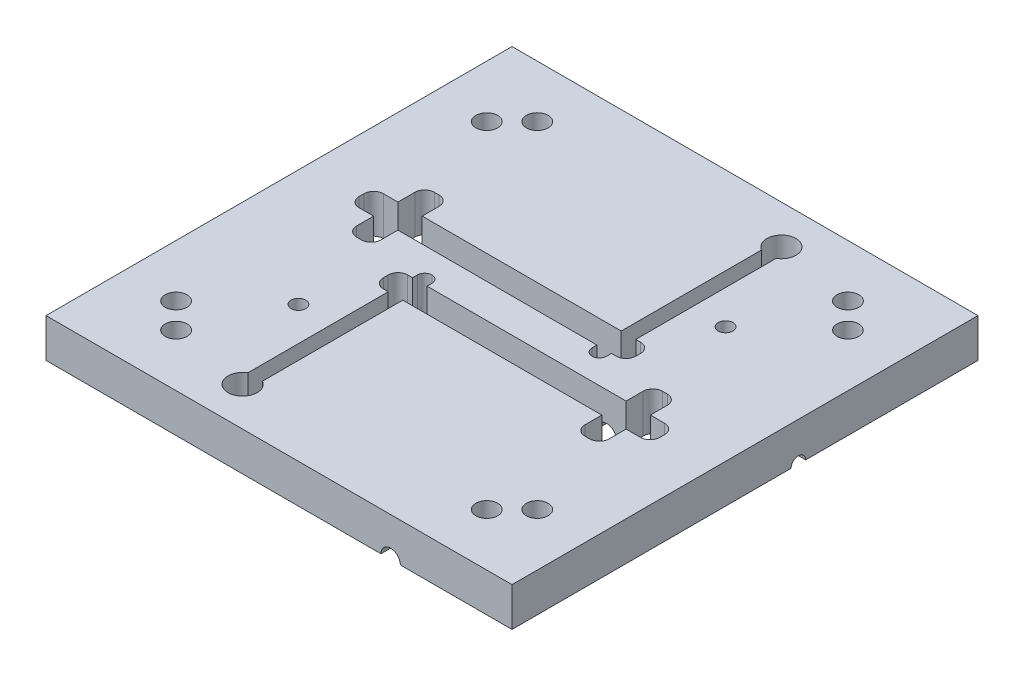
ISO-10303-21;
HEADER;
FILE_DESCRIPTION(('STEP AP214'),'2;1');
FILE_NAME('part.step','',(''),(''),'','','');
FILE_SCHEMA(('AUTOMOTIVE_DESIGN { 1 0 10303 214 1 1 1 1 }'));
ENDSEC;
DATA;
#1=APPLICATION_CONTEXT('core data for automotive mechanical design processes');
#2=APPLICATION_PROTOCOL_DEFINITION('international standard','automotive_design',2000,#1);
#3=PRODUCT_CONTEXT('',#1,'mechanical');
#4=PRODUCT('Part','Part','',(#3));
#5=PRODUCT_RELATED_PRODUCT_CATEGORY('part','',(#4));
#6=PRODUCT_DEFINITION_FORMATION('','',#4);
#7=PRODUCT_DEFINITION_CONTEXT('part definition',#1,'design');
#8=PRODUCT_DEFINITION('design','',#6,#7);
#9=PRODUCT_DEFINITION_SHAPE('','',#8);
#10=(LENGTH_UNIT() NAMED_UNIT(*) SI_UNIT(.MILLI.,.METRE.));
#11=(NAMED_UNIT(*) PLANE_ANGLE_UNIT() SI_UNIT($,.RADIAN.));
#12=(NAMED_UNIT(*) SI_UNIT($,.STERADIAN.) SOLID_ANGLE_UNIT());
#13=UNCERTAINTY_MEASURE_WITH_UNIT(LENGTH_MEASURE(1.E-05),#10,'distance_accuracy_value','');
#14=(GEOMETRIC_REPRESENTATION_CONTEXT(3) GLOBAL_UNCERTAINTY_ASSIGNED_CONTEXT((#13)) GLOBAL_UNIT_ASSIGNED_CONTEXT((#10,
#11,#12)) REPRESENTATION_CONTEXT('',''));
#15=CARTESIAN_POINT('',(0.,0.,0.));
#16=DIRECTION('',(0.,0.,1.));
#17=DIRECTION('',(1.,0.,0.));
#18=AXIS2_PLACEMENT_3D('',#15,#16,#17);
#19=CARTESIAN_POINT('',(49.2252,-12.7,-7.92480000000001));
#20=DIRECTION('',(0.,1.,0.));
#21=DIRECTION('',(0.,0.,1.));
#22=AXIS2_PLACEMENT_3D('',#19,#20,#21);
#23=CYLINDRICAL_SURFACE('',#22,4.7498);
#24=DIRECTION('',(0.,-1.,0.));
#25=VECTOR('',#24,1.);
#26=CARTESIAN_POINT('',(49.2252,-12.7,-3.175));
#27=LINE('',#26,#25);
#28=CARTESIAN_POINT('',(49.2252,12.7,-3.175));
#29=VERTEX_POINT('',#28);
#30=CARTESIAN_POINT('',(49.2252,-12.7,-3.175));
#31=VERTEX_POINT('',#30);
#32=EDGE_CURVE('E960',#29,#31,#27,.T.);
#33=ORIENTED_EDGE('',*,*,#32,.F.);
#34=CARTESIAN_POINT('',(49.2252,12.7,-7.92480000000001));
#35=DIRECTION('',(0.,-1.,0.));
#36=DIRECTION('',(0.,0.,-1.));
#37=AXIS2_PLACEMENT_3D('',#34,#35,#36);
#38=CIRCLE('',#37,4.7498);
#39=CARTESIAN_POINT('',(53.975,12.7,-7.92480000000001));
#40=VERTEX_POINT('',#39);
#41=EDGE_CURVE('E44',#29,#40,#38,.F.);
#42=ORIENTED_EDGE('',*,*,#41,.T.);
#43=DIRECTION('',(0.,-1.,0.));
#44=VECTOR('',#43,1.);
#45=CARTESIAN_POINT('',(53.975,-12.7,-7.92480000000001));
#46=LINE('',#45,#44);
#47=CARTESIAN_POINT('',(53.975,-12.7,-7.92480000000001));
#48=VERTEX_POINT('',#47);
#49=EDGE_CURVE('E963',#48,#40,#46,.F.);
#50=ORIENTED_EDGE('',*,*,#49,.F.);
#51=CARTESIAN_POINT('',(49.2252,-12.7,-7.92480000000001));
#52=DIRECTION('',(0.,-1.,0.));
#53=DIRECTION('',(0.,0.,-1.));
#54=AXIS2_PLACEMENT_3D('',#51,#52,#53);
#55=CIRCLE('',#54,4.7498);
#56=EDGE_CURVE('E11',#48,#31,#55,.T.);
#57=ORIENTED_EDGE('',*,*,#56,.T.);
#58=EDGE_LOOP('',(#33,#42,#50,#57));
#59=FACE_BOUND('',#58,.T.);
#60=ADVANCED_FACE('F37',(#59),#23,.F.);
#61=CARTESIAN_POINT('',(49.1998,-12.7,-7.92480000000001));
#62=DIRECTION('',(0.,-1.,0.));
#63=DIRECTION('',(0.,0.,-1.));
#64=AXIS2_PLACEMENT_3D('',#61,#62,#63);
#65=CYLINDRICAL_SURFACE('',#64,4.7498);
#66=DIRECTION('',(0.,1.,0.));
#67=VECTOR('',#66,1.);
#68=CARTESIAN_POINT('',(49.1998,-12.7,-3.175));
#69=LINE('',#68,#67);
#70=CARTESIAN_POINT('',(49.1998,-12.7,-3.175));
#71=VERTEX_POINT('',#70);
#72=CARTESIAN_POINT('',(49.1998,12.7,-3.175));
#73=VERTEX_POINT('',#72);
#74=EDGE_CURVE('E540',#71,#73,#69,.T.);
#75=ORIENTED_EDGE('',*,*,#74,.F.);
#76=CARTESIAN_POINT('',(49.1998,-12.7,-7.92480000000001));
#77=DIRECTION('',(0.,-1.,0.));
#78=DIRECTION('',(0.,0.,-1.));
#79=AXIS2_PLACEMENT_3D('',#76,#77,#78);
#80=CIRCLE('',#79,4.7498);
#81=CARTESIAN_POINT('',(44.45,-12.7,-7.92480000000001));
#82=VERTEX_POINT('',#81);
#83=EDGE_CURVE('E956',#71,#82,#80,.T.);
#84=ORIENTED_EDGE('',*,*,#83,.T.);
#85=DIRECTION('',(0.,1.,0.));
#86=VECTOR('',#85,1.);
#87=CARTESIAN_POINT('',(44.45,-12.7,-7.92480000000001));
#88=LINE('',#87,#86);
#89=CARTESIAN_POINT('',(44.45,12.7,-7.92480000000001));
#90=VERTEX_POINT('',#89);
#91=EDGE_CURVE('E953',#90,#82,#88,.F.);
#92=ORIENTED_EDGE('',*,*,#91,.F.);
#93=CARTESIAN_POINT('',(49.1998,12.7,-7.92480000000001));
#94=DIRECTION('',(0.,-1.,0.));
#95=DIRECTION('',(0.,0.,-1.));
#96=AXIS2_PLACEMENT_3D('',#93,#94,#95);
#97=CIRCLE('',#96,4.7498);
#98=EDGE_CURVE('E958',#90,#73,#97,.F.);
#99=ORIENTED_EDGE('',*,*,#98,.T.);
#100=EDGE_LOOP('',(#75,#84,#92,#99));
#101=FACE_BOUND('',#100,.T.);
#102=ADVANCED_FACE('F1299',(#101),#65,.F.);
#103=CARTESIAN_POINT('',(-152.4,-12.7,-152.4));
#104=DIRECTION('',(0.,-1.,0.));
#105=DIRECTION('',(0.,0.,-1.));
#106=AXIS2_PLACEMENT_3D('',#103,#104,#105);
#107=PLANE('',#106);
#108=CARTESIAN_POINT('',(76.2,-12.7,-63.5));
#109=DIRECTION('',(0.,-1.,0.));
#110=DIRECTION('',(0.,0.,-1.));
#111=AXIS2_PLACEMENT_3D('',#108,#109,#110);
#112=CIRCLE('',#111,4.82599999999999);
#113=CARTESIAN_POINT('',(76.2,-12.7,-68.326));
#114=VERTEX_POINT('',#113);
#115=EDGE_CURVE('E1319',#114,#114,#112,.T.);
#116=ORIENTED_EDGE('',*,*,#115,.F.);
#117=EDGE_LOOP('',(#116));
#118=FACE_BOUND('',#117,.T.);
#119=DIRECTION('',(0.,0.,1.));
#120=VECTOR('',#119,1.);
#121=CARTESIAN_POINT('',(44.45,-12.7,-130.175));
#122=LINE('',#121,#120);
#123=CARTESIAN_POINT('',(44.45,-12.7,-30.1625));
#124=VERTEX_POINT('',#123);
#125=CARTESIAN_POINT('',(44.45,-12.7,-26.9748));
#126=VERTEX_POINT('',#125);
#127=EDGE_CURVE('E979',#124,#126,#122,.T.);
#128=ORIENTED_EDGE('',*,*,#127,.T.);
#129=DIRECTION('',(-1.,0.,0.));
#130=VECTOR('',#129,1.);
#131=CARTESIAN_POINT('',(-117.475,-12.7,-26.9748));
#132=LINE('',#131,#130);
#133=CARTESIAN_POINT('',(-66.675,-12.7,-26.9748));
#134=VERTEX_POINT('',#133);
#135=EDGE_CURVE('E605',#126,#134,#132,.T.);
#136=ORIENTED_EDGE('',*,*,#135,.T.);
#137=DIRECTION('',(0.,0.,-1.));
#138=VECTOR('',#137,1.);
#139=CARTESIAN_POINT('',(-66.675,-12.7,25.4));
#140=LINE('',#139,#138);
#141=CARTESIAN_POINT('',(-66.675,-12.7,-152.4));
#142=VERTEX_POINT('',#141);
#143=EDGE_CURVE('E1063',#142,#134,#140,.F.);
#144=ORIENTED_EDGE('',*,*,#143,.F.);
#145=DIRECTION('',(-1.,0.,0.));
#146=VECTOR('',#145,1.);
#147=CARTESIAN_POINT('',(-152.4,-12.7,-152.4));
#148=LINE('',#147,#146);
#149=CARTESIAN_POINT('',(152.4,-12.7,-152.4));
#150=VERTEX_POINT('',#149);
#151=EDGE_CURVE('E698',#150,#142,#148,.T.);
#152=ORIENTED_EDGE('',*,*,#151,.F.);
#153=DIRECTION('',(0.,0.,-1.));
#154=VECTOR('',#153,1.);
#155=CARTESIAN_POINT('',(152.4,-12.7,152.4));
#156=LINE('',#155,#154);
#157=CARTESIAN_POINT('',(152.4,-12.7,-39.6875));
#158=VERTEX_POINT('',#157);
#159=EDGE_CURVE('E693',#158,#150,#156,.T.);
#160=ORIENTED_EDGE('',*,*,#159,.F.);
#161=DIRECTION('',(1.,0.,0.));
#162=VECTOR('',#161,1.);
#163=CARTESIAN_POINT('',(25.4,-12.7,-39.6875));
#164=LINE('',#163,#162);
#165=CARTESIAN_POINT('',(53.975,-12.7,-39.6875));
#166=VERTEX_POINT('',#165);
#167=EDGE_CURVE('E574',#166,#158,#164,.T.);
#168=ORIENTED_EDGE('',*,*,#167,.F.);
#169=DIRECTION('',(0.,0.,-1.));
#170=VECTOR('',#169,1.);
#171=CARTESIAN_POINT('',(53.975,-12.7,-130.175));
#172=LINE('',#171,#170);
#173=CARTESIAN_POINT('',(53.975,-12.7,-118.758453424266));
#174=VERTEX_POINT('',#173);
#175=EDGE_CURVE('E985',#166,#174,#172,.T.);
#176=ORIENTED_EDGE('',*,*,#175,.T.);
#177=CARTESIAN_POINT('',(49.1998,-12.7,-127.));
#178=DIRECTION('',(0.,1.,0.));
#179=DIRECTION('',(0.,0.,1.));
#180=AXIS2_PLACEMENT_3D('',#177,#178,#179);
#181=CIRCLE('',#180,9.52500000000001);
#182=CARTESIAN_POINT('',(44.45,-12.7,-118.743788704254));
#183=VERTEX_POINT('',#182);
#184=EDGE_CURVE('E557',#174,#183,#181,.T.);
#185=ORIENTED_EDGE('',*,*,#184,.T.);
#186=CARTESIAN_POINT('',(44.45,-12.7,-39.6875));
#187=VERTEX_POINT('',#186);
#188=EDGE_CURVE('E535',#183,#187,#122,.T.);
#189=ORIENTED_EDGE('',*,*,#188,.T.);
#190=CARTESIAN_POINT('',(25.4,-12.7,-39.6875));
#191=VERTEX_POINT('',#190);
#192=EDGE_CURVE('E575',#191,#187,#164,.T.);
#193=ORIENTED_EDGE('',*,*,#192,.F.);
#194=DIRECTION('',(0.,0.,1.));
#195=VECTOR('',#194,1.);
#196=CARTESIAN_POINT('',(25.4,-12.7,-152.4));
#197=LINE('',#196,#195);
#198=CARTESIAN_POINT('',(25.4,-12.7,-30.1625));
#199=VERTEX_POINT('',#198);
#200=EDGE_CURVE('E813',#191,#199,#197,.T.);
#201=ORIENTED_EDGE('',*,*,#200,.T.);
#202=DIRECTION('',(1.,0.,0.));
#203=VECTOR('',#202,1.);
#204=CARTESIAN_POINT('',(25.4,-12.7,-30.1625));
#205=LINE('',#204,#203);
#206=EDGE_CURVE('E570',#124,#199,#205,.F.);
#207=ORIENTED_EDGE('',*,*,#206,.F.);
#208=EDGE_LOOP('',(#128,#136,#144,#152,#160,#168,#176,#185,#189,#193,#201,#207));
#209=FACE_BOUND('',#208,.T.);
#210=CARTESIAN_POINT('',(101.6,-12.7,-118.11));
#211=DIRECTION('',(0.,1.,0.));
#212=DIRECTION('',(0.,0.,1.));
#213=AXIS2_PLACEMENT_3D('',#210,#211,#212);
#214=CIRCLE('',#213,7.1374);
#215=CARTESIAN_POINT('',(101.6,-12.7,-110.9726));
#216=VERTEX_POINT('',#215);
#217=EDGE_CURVE('E664',#216,#216,#214,.T.);
#218=ORIENTED_EDGE('',*,*,#217,.T.);
#219=EDGE_LOOP('',(#218));
#220=FACE_BOUND('',#219,.T.);
#221=CARTESIAN_POINT('',(118.11,-12.7,-101.6));
#222=DIRECTION('',(0.,1.,0.));
#223=DIRECTION('',(0.,0.,1.));
#224=AXIS2_PLACEMENT_3D('',#221,#222,#223);
#225=CIRCLE('',#224,7.11200000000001);
#226=CARTESIAN_POINT('',(118.11,-12.7,-94.488));
#227=VERTEX_POINT('',#226);
#228=EDGE_CURVE('E676',#227,#227,#225,.T.);
#229=ORIENTED_EDGE('',*,*,#228,.T.);
#230=EDGE_LOOP('',(#229));
#231=FACE_BOUND('',#230,.T.);
#232=ADVANCED_FACE('F1303',(#118,#209,#220,#231),#107,.T.);
#233=CARTESIAN_POINT('',(-117.475,-12.7,-26.9748));
#234=DIRECTION('',(0.,0.,-1.));
#235=DIRECTION('',(-1.,0.,0.));
#236=AXIS2_PLACEMENT_3D('',#233,#234,#235);
#237=PLANE('',#236);
#238=ORIENTED_EDGE('',*,*,#135,.F.);
#239=DIRECTION('',(0.,1.,0.));
#240=VECTOR('',#239,1.);
#241=CARTESIAN_POINT('',(44.45,-12.7,-26.9748));
#242=LINE('',#241,#240);
#243=CARTESIAN_POINT('',(44.45,12.7,-26.9748));
#244=VERTEX_POINT('',#243);
#245=EDGE_CURVE('E1002',#126,#244,#242,.T.);
#246=ORIENTED_EDGE('',*,*,#245,.T.);
#247=DIRECTION('',(-1.,0.,0.));
#248=VECTOR('',#247,1.);
#249=CARTESIAN_POINT('',(-117.475,12.7,-26.9748));
#250=LINE('',#249,#248);
#251=CARTESIAN_POINT('',(-85.725,12.7,-26.9748));
#252=VERTEX_POINT('',#251);
#253=EDGE_CURVE('E551',#244,#252,#250,.T.);
#254=ORIENTED_EDGE('',*,*,#253,.T.);
#255=DIRECTION('',(0.,1.,0.));
#256=VECTOR('',#255,1.);
#257=CARTESIAN_POINT('',(-85.725,-12.7,-26.9748));
#258=LINE('',#257,#256);
#259=CARTESIAN_POINT('',(-85.725,-12.7,-26.9748));
#260=VERTEX_POINT('',#259);
#261=EDGE_CURVE('E768',#260,#252,#258,.T.);
#262=ORIENTED_EDGE('',*,*,#261,.F.);
#263=CARTESIAN_POINT('',(-79.375,-12.7,-26.9748));
#264=VERTEX_POINT('',#263);
#265=EDGE_CURVE('E1248',#264,#260,#132,.T.);
#266=ORIENTED_EDGE('',*,*,#265,.F.);
#267=CARTESIAN_POINT('',(-73.025,-12.7,-26.9748));
#268=DIRECTION('',(0.,0.,-1.));
#269=DIRECTION('',(-1.,0.,0.));
#270=AXIS2_PLACEMENT_3D('',#267,#268,#269);
#271=CIRCLE('',#270,6.35);
#272=EDGE_CURVE('E1065',#264,#134,#271,.T.);
#273=ORIENTED_EDGE('',*,*,#272,.T.);
#274=EDGE_LOOP('',(#238,#246,#254,#262,#266,#273));
#275=FACE_BOUND('',#274,.T.);
#276=ADVANCED_FACE('F1253',(#275),#237,.F.);
#277=CARTESIAN_POINT('',(-117.475,-12.7,-11.0998));
#278=DIRECTION('',(0.,0.,1.));
#279=DIRECTION('',(1.,0.,0.));
#280=AXIS2_PLACEMENT_3D('',#277,#278,#279);
#281=PLANE('',#280);
#282=DIRECTION('',(1.,0.,0.));
#283=VECTOR('',#282,1.);
#284=CARTESIAN_POINT('',(-117.475,12.7,-11.0998));
#285=LINE('',#284,#283);
#286=CARTESIAN_POINT('',(-85.725,12.7,-11.0998));
#287=VERTEX_POINT('',#286);
#288=CARTESIAN_POINT('',(44.45,12.7,-11.0998));
#289=VERTEX_POINT('',#288);
#290=EDGE_CURVE('E585',#287,#289,#285,.T.);
#291=ORIENTED_EDGE('',*,*,#290,.T.);
#292=DIRECTION('',(0.,-1.,0.));
#293=VECTOR('',#292,1.);
#294=CARTESIAN_POINT('',(44.45,-12.7,-11.0998));
#295=LINE('',#294,#293);
#296=CARTESIAN_POINT('',(44.45,-12.7,-11.0998));
#297=VERTEX_POINT('',#296);
#298=EDGE_CURVE('E999',#289,#297,#295,.T.);
#299=ORIENTED_EDGE('',*,*,#298,.T.);
#300=DIRECTION('',(1.,0.,0.));
#301=VECTOR('',#300,1.);
#302=CARTESIAN_POINT('',(-117.475,-12.7,-11.0998));
#303=LINE('',#302,#301);
#304=CARTESIAN_POINT('',(-66.675,-12.7,-11.0998));
#305=VERTEX_POINT('',#304);
#306=EDGE_CURVE('E1637',#305,#297,#303,.T.);
#307=ORIENTED_EDGE('',*,*,#306,.F.);
#308=CARTESIAN_POINT('',(-73.025,-12.7,-11.0998));
#309=DIRECTION('',(0.,0.,1.));
#310=DIRECTION('',(1.,0.,0.));
#311=AXIS2_PLACEMENT_3D('',#308,#309,#310);
#312=CIRCLE('',#311,6.35);
#313=CARTESIAN_POINT('',(-79.375,-12.7,-11.0998));
#314=VERTEX_POINT('',#313);
#315=EDGE_CURVE('E914',#305,#314,#312,.T.);
#316=ORIENTED_EDGE('',*,*,#315,.T.);
#317=CARTESIAN_POINT('',(-85.725,-12.7,-11.0998));
#318=VERTEX_POINT('',#317);
#319=EDGE_CURVE('E598',#318,#314,#303,.T.);
#320=ORIENTED_EDGE('',*,*,#319,.F.);
#321=DIRECTION('',(0.,-1.,0.));
#322=VECTOR('',#321,1.);
#323=CARTESIAN_POINT('',(-85.725,-12.7,-11.0998));
#324=LINE('',#323,#322);
#325=EDGE_CURVE('E765',#287,#318,#324,.T.);
#326=ORIENTED_EDGE('',*,*,#325,.F.);
#327=EDGE_LOOP('',(#291,#299,#307,#316,#320,#326));
#328=FACE_BOUND('',#327,.T.);
#329=ADVANCED_FACE('F1504',(#328),#281,.F.);
#330=CARTESIAN_POINT('',(25.4,-12.7,-34.925));
#331=DIRECTION('',(1.,0.,0.));
#332=DIRECTION('',(0.,0.,-1.));
#333=AXIS2_PLACEMENT_3D('',#330,#331,#332);
#334=CYLINDRICAL_SURFACE('',#333,4.7625);
#335=ORIENTED_EDGE('',*,*,#192,.T.);
#336=CARTESIAN_POINT('',(44.45,-12.7,-34.925));
#337=DIRECTION('',(-1.,0.,0.));
#338=DIRECTION('',(0.,0.,1.));
#339=AXIS2_PLACEMENT_3D('',#336,#337,#338);
#340=CIRCLE('',#339,4.7625);
#341=EDGE_CURVE('E996',#187,#124,#340,.F.);
#342=ORIENTED_EDGE('',*,*,#341,.T.);
#343=ORIENTED_EDGE('',*,*,#206,.T.);
#344=CARTESIAN_POINT('',(25.4,-12.7,-34.925));
#345=DIRECTION('',(1.,0.,0.));
#346=DIRECTION('',(0.,0.,-1.));
#347=AXIS2_PLACEMENT_3D('',#344,#345,#346);
#348=CIRCLE('',#347,4.7625);
#349=EDGE_CURVE('E567',#191,#199,#348,.T.);
#350=ORIENTED_EDGE('',*,*,#349,.F.);
#351=EDGE_LOOP('',(#335,#342,#343,#350));
#352=FACE_BOUND('',#351,.T.);
#353=ADVANCED_FACE('F1360',(#352),#334,.F.);
#354=CARTESIAN_POINT('',(-49.1998,-12.7,7.92480000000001));
#355=DIRECTION('',(0.,-1.,0.));
#356=DIRECTION('',(0.,0.,-1.));
#357=AXIS2_PLACEMENT_3D('',#354,#355,#356);
#358=CYLINDRICAL_SURFACE('',#357,4.7498);
#359=DIRECTION('',(0.,1.,0.));
#360=VECTOR('',#359,1.);
#361=CARTESIAN_POINT('',(-49.1998,-12.7,3.17500000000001));
#362=LINE('',#361,#360);
#363=CARTESIAN_POINT('',(-49.1998,-12.7,3.17500000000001));
#364=VERTEX_POINT('',#363);
#365=CARTESIAN_POINT('',(-49.1998,12.7,3.17500000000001));
#366=VERTEX_POINT('',#365);
#367=EDGE_CURVE('E940',#364,#366,#362,.T.);
#368=ORIENTED_EDGE('',*,*,#367,.F.);
#369=CARTESIAN_POINT('',(-49.1998,-12.7,7.92480000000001));
#370=DIRECTION('',(0.,-1.,0.));
#371=DIRECTION('',(0.,0.,-1.));
#372=AXIS2_PLACEMENT_3D('',#369,#370,#371);
#373=CIRCLE('',#372,4.7498);
#374=CARTESIAN_POINT('',(-44.45,-12.7,7.92480000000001));
#375=VERTEX_POINT('',#374);
#376=EDGE_CURVE('E946',#364,#375,#373,.T.);
#377=ORIENTED_EDGE('',*,*,#376,.T.);
#378=DIRECTION('',(0.,1.,0.));
#379=VECTOR('',#378,1.);
#380=CARTESIAN_POINT('',(-44.45,-12.7,7.92480000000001));
#381=LINE('',#380,#379);
#382=CARTESIAN_POINT('',(-44.45,12.7,7.92480000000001));
#383=VERTEX_POINT('',#382);
#384=EDGE_CURVE('E943',#383,#375,#381,.F.);
#385=ORIENTED_EDGE('',*,*,#384,.F.);
#386=CARTESIAN_POINT('',(-49.1998,12.7,7.92480000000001));
#387=DIRECTION('',(0.,-1.,0.));
#388=DIRECTION('',(0.,0.,-1.));
#389=AXIS2_PLACEMENT_3D('',#386,#387,#388);
#390=CIRCLE('',#389,4.7498);
#391=EDGE_CURVE('E948',#383,#366,#390,.F.);
#392=ORIENTED_EDGE('',*,*,#391,.T.);
#393=EDGE_LOOP('',(#368,#377,#385,#392));
#394=FACE_BOUND('',#393,.T.);
#395=ADVANCED_FACE('F1354',(#394),#358,.F.);
#396=CARTESIAN_POINT('',(-49.2252,-12.7,7.92480000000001));
#397=DIRECTION('',(0.,-1.,0.));
#398=DIRECTION('',(0.,0.,-1.));
#399=AXIS2_PLACEMENT_3D('',#396,#397,#398);
#400=CYLINDRICAL_SURFACE('',#399,4.7498);
#401=DIRECTION('',(0.,1.,0.));
#402=VECTOR('',#401,1.);
#403=CARTESIAN_POINT('',(-53.975,-12.7,7.92480000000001));
#404=LINE('',#403,#402);
#405=CARTESIAN_POINT('',(-53.975,-12.7,7.92480000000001));
#406=VERTEX_POINT('',#405);
#407=CARTESIAN_POINT('',(-53.975,12.7,7.92480000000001));
#408=VERTEX_POINT('',#407);
#409=EDGE_CURVE('E929',#406,#408,#404,.T.);
#410=ORIENTED_EDGE('',*,*,#409,.F.);
#411=CARTESIAN_POINT('',(-49.2252,-12.7,7.92480000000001));
#412=DIRECTION('',(0.,-1.,0.));
#413=DIRECTION('',(0.,0.,-1.));
#414=AXIS2_PLACEMENT_3D('',#411,#412,#413);
#415=CIRCLE('',#414,4.7498);
#416=CARTESIAN_POINT('',(-49.2252,-12.7,3.17500000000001));
#417=VERTEX_POINT('',#416);
#418=EDGE_CURVE('E935',#406,#417,#415,.T.);
#419=ORIENTED_EDGE('',*,*,#418,.T.);
#420=DIRECTION('',(0.,1.,0.));
#421=VECTOR('',#420,1.);
#422=CARTESIAN_POINT('',(-49.2252,-12.7,3.17500000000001));
#423=LINE('',#422,#421);
#424=CARTESIAN_POINT('',(-49.2252,12.7,3.17500000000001));
#425=VERTEX_POINT('',#424);
#426=EDGE_CURVE('E932',#425,#417,#423,.F.);
#427=ORIENTED_EDGE('',*,*,#426,.F.);
#428=CARTESIAN_POINT('',(-49.2252,12.7,7.92480000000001));
#429=DIRECTION('',(0.,-1.,0.));
#430=DIRECTION('',(0.,0.,-1.));
#431=AXIS2_PLACEMENT_3D('',#428,#429,#430);
#432=CIRCLE('',#431,4.7498);
#433=EDGE_CURVE('E938',#425,#408,#432,.F.);
#434=ORIENTED_EDGE('',*,*,#433,.T.);
#435=EDGE_LOOP('',(#410,#419,#427,#434));
#436=FACE_BOUND('',#435,.T.);
#437=ADVANCED_FACE('F1346',(#436),#400,.F.);
#438=ORIENTED_EDGE('',*,*,#56,.F.);
#439=CARTESIAN_POINT('',(53.975,-12.7,-11.0998));
#440=VERTEX_POINT('',#439);
#441=EDGE_CURVE('E971',#48,#440,#172,.T.);
#442=ORIENTED_EDGE('',*,*,#441,.T.);
#443=CARTESIAN_POINT('',(57.15,-12.7,-11.0998));
#444=VERTEX_POINT('',#443);
#445=EDGE_CURVE('E594',#440,#444,#303,.T.);
#446=ORIENTED_EDGE('',*,*,#445,.T.);
#447=CARTESIAN_POINT('',(57.15,-12.7,-17.4498));
#448=DIRECTION('',(0.,-1.,0.));
#449=DIRECTION('',(0.,0.,-1.));
#450=AXIS2_PLACEMENT_3D('',#447,#448,#449);
#451=CIRCLE('',#450,6.35);
#452=CARTESIAN_POINT('',(63.5,-12.7,-17.4498));
#453=VERTEX_POINT('',#452);
#454=EDGE_CURVE('E810',#453,#444,#451,.T.);
#455=ORIENTED_EDGE('',*,*,#454,.F.);
#456=DIRECTION('',(0.,0.,-1.));
#457=VECTOR('',#456,1.);
#458=CARTESIAN_POINT('',(63.5,-12.7,-11.0998));
#459=LINE('',#458,#457);
#460=CARTESIAN_POINT('',(63.5,-12.7,-20.6248));
#461=VERTEX_POINT('',#460);
#462=EDGE_CURVE('E597',#453,#461,#459,.T.);
#463=ORIENTED_EDGE('',*,*,#462,.T.);
#464=CARTESIAN_POINT('',(57.15,-12.7,-20.6248));
#465=DIRECTION('',(0.,-1.,0.));
#466=DIRECTION('',(0.,0.,-1.));
#467=AXIS2_PLACEMENT_3D('',#464,#465,#466);
#468=CIRCLE('',#467,6.35);
#469=CARTESIAN_POINT('',(57.15,-12.7,-26.9748));
#470=VERTEX_POINT('',#469);
#471=EDGE_CURVE('E799',#470,#461,#468,.T.);
#472=ORIENTED_EDGE('',*,*,#471,.F.);
#473=CARTESIAN_POINT('',(53.975,-12.7,-26.9748));
#474=VERTEX_POINT('',#473);
#475=EDGE_CURVE('E601',#470,#474,#132,.T.);
#476=ORIENTED_EDGE('',*,*,#475,.T.);
#477=CARTESIAN_POINT('',(53.975,-12.7,-30.1625));
#478=VERTEX_POINT('',#477);
#479=EDGE_CURVE('E988',#474,#478,#172,.T.);
#480=ORIENTED_EDGE('',*,*,#479,.T.);
#481=CARTESIAN_POINT('',(152.4,-12.7,-30.1625));
#482=VERTEX_POINT('',#481);
#483=EDGE_CURVE('E571',#482,#478,#205,.F.);
#484=ORIENTED_EDGE('',*,*,#483,.F.);
#485=CARTESIAN_POINT('',(152.4,-12.7,152.4));
#486=VERTEX_POINT('',#485);
#487=EDGE_CURVE('E694',#486,#482,#156,.T.);
#488=ORIENTED_EDGE('',*,*,#487,.F.);
#489=DIRECTION('',(1.,0.,0.));
#490=VECTOR('',#489,1.);
#491=CARTESIAN_POINT('',(-152.4,-12.7,152.4));
#492=LINE('',#491,#490);
#493=CARTESIAN_POINT('',(79.375,-12.7,152.4));
#494=VERTEX_POINT('',#493);
#495=EDGE_CURVE('E689',#494,#486,#492,.T.);
#496=ORIENTED_EDGE('',*,*,#495,.F.);
#497=DIRECTION('',(0.,0.,1.));
#498=VECTOR('',#497,1.);
#499=CARTESIAN_POINT('',(79.375,-12.7,-25.4));
#500=LINE('',#499,#498);
#501=CARTESIAN_POINT('',(79.375,-12.7,26.9748));
#502=VERTEX_POINT('',#501);
#503=EDGE_CURVE('E1080',#502,#494,#500,.T.);
#504=ORIENTED_EDGE('',*,*,#503,.F.);
#505=DIRECTION('',(1.,0.,0.));
#506=VECTOR('',#505,1.);
#507=CARTESIAN_POINT('',(117.348,-12.7,26.9748));
#508=LINE('',#507,#506);
#509=CARTESIAN_POINT('',(85.725,-12.7,26.9748));
#510=VERTEX_POINT('',#509);
#511=EDGE_CURVE('E1664',#502,#510,#508,.T.);
#512=ORIENTED_EDGE('',*,*,#511,.T.);
#513=DIRECTION('',(0.,0.,1.));
#514=VECTOR('',#513,1.);
#515=CARTESIAN_POINT('',(85.725,-12.7,-6.35000000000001));
#516=LINE('',#515,#514);
#517=CARTESIAN_POINT('',(85.725,-12.7,38.1));
#518=VERTEX_POINT('',#517);
#519=EDGE_CURVE('E1135',#510,#518,#516,.T.);
#520=ORIENTED_EDGE('',*,*,#519,.T.);
#521=CARTESIAN_POINT('',(92.075,-12.7,38.1));
#522=DIRECTION('',(0.,-1.,0.));
#523=DIRECTION('',(0.,0.,-1.));
#524=AXIS2_PLACEMENT_3D('',#521,#522,#523);
#525=CIRCLE('',#524,6.35);
#526=CARTESIAN_POINT('',(92.075,-12.7,44.45));
#527=VERTEX_POINT('',#526);
#528=EDGE_CURVE('E857',#527,#518,#525,.T.);
#529=ORIENTED_EDGE('',*,*,#528,.F.);
#530=DIRECTION('',(1.,0.,0.));
#531=VECTOR('',#530,1.);
#532=CARTESIAN_POINT('',(85.725,-12.7,44.45));
#533=LINE('',#532,#531);
#534=CARTESIAN_POINT('',(95.25,-12.7,44.45));
#535=VERTEX_POINT('',#534);
#536=EDGE_CURVE('E1139',#527,#535,#533,.T.);
#537=ORIENTED_EDGE('',*,*,#536,.T.);
#538=CARTESIAN_POINT('',(95.25,-12.7,38.1));
#539=DIRECTION('',(0.,-1.,0.));
#540=DIRECTION('',(0.,0.,-1.));
#541=AXIS2_PLACEMENT_3D('',#538,#539,#540);
#542=CIRCLE('',#541,6.35);
#543=CARTESIAN_POINT('',(101.6,-12.7,38.1));
#544=VERTEX_POINT('',#543);
#545=EDGE_CURVE('E846',#544,#535,#542,.T.);
#546=ORIENTED_EDGE('',*,*,#545,.F.);
#547=DIRECTION('',(0.,0.,-1.));
#548=VECTOR('',#547,1.);
#549=CARTESIAN_POINT('',(101.6,-12.7,-6.35000000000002));
#550=LINE('',#549,#548);
#551=CARTESIAN_POINT('',(101.6,-12.7,26.9748));
#552=VERTEX_POINT('',#551);
#553=EDGE_CURVE('E562',#544,#552,#550,.T.);
#554=ORIENTED_EDGE('',*,*,#553,.T.);
#555=CARTESIAN_POINT('',(110.998,-12.7,26.9748));
#556=VERTEX_POINT('',#555);
#557=EDGE_CURVE('E1111',#552,#556,#508,.T.);
#558=ORIENTED_EDGE('',*,*,#557,.T.);
#559=CARTESIAN_POINT('',(110.998,-12.7,20.6248));
#560=DIRECTION('',(0.,-1.,0.));
#561=DIRECTION('',(0.,0.,-1.));
#562=AXIS2_PLACEMENT_3D('',#559,#560,#561);
#563=CIRCLE('',#562,6.35);
#564=CARTESIAN_POINT('',(117.348,-12.7,20.6248));
#565=VERTEX_POINT('',#564);
#566=EDGE_CURVE('E883',#565,#556,#563,.T.);
#567=ORIENTED_EDGE('',*,*,#566,.F.);
#568=DIRECTION('',(0.,0.,-1.));
#569=VECTOR('',#568,1.);
#570=CARTESIAN_POINT('',(117.348,-12.7,26.9748));
#571=LINE('',#570,#569);
#572=CARTESIAN_POINT('',(117.348,-12.7,17.4498));
#573=VERTEX_POINT('',#572);
#574=EDGE_CURVE('E1105',#565,#573,#571,.T.);
#575=ORIENTED_EDGE('',*,*,#574,.T.);
#576=CARTESIAN_POINT('',(110.998,-12.7,17.4498));
#577=DIRECTION('',(0.,-1.,0.));
#578=DIRECTION('',(0.,0.,-1.));
#579=AXIS2_PLACEMENT_3D('',#576,#577,#578);
#580=CIRCLE('',#579,6.35);
#581=CARTESIAN_POINT('',(110.998,-12.7,11.0998));
#582=VERTEX_POINT('',#581);
#583=EDGE_CURVE('E872',#582,#573,#580,.T.);
#584=ORIENTED_EDGE('',*,*,#583,.F.);
#585=DIRECTION('',(-1.,0.,0.));
#586=VECTOR('',#585,1.);
#587=CARTESIAN_POINT('',(117.348,-12.7,11.0998));
#588=LINE('',#587,#586);
#589=CARTESIAN_POINT('',(101.6,-12.7,11.0998));
#590=VERTEX_POINT('',#589);
#591=EDGE_CURVE('E1109',#582,#590,#588,.T.);
#592=ORIENTED_EDGE('',*,*,#591,.T.);
#593=CARTESIAN_POINT('',(101.6,-12.7,0.));
#594=VERTEX_POINT('',#593);
#595=EDGE_CURVE('E1140',#590,#594,#550,.T.);
#596=ORIENTED_EDGE('',*,*,#595,.T.);
#597=CARTESIAN_POINT('',(95.25,-12.7,0.));
#598=DIRECTION('',(0.,-1.,0.));
#599=DIRECTION('',(0.,0.,-1.));
#600=AXIS2_PLACEMENT_3D('',#597,#598,#599);
#601=CIRCLE('',#600,6.35);
#602=CARTESIAN_POINT('',(95.25,-12.7,-6.35000000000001));
#603=VERTEX_POINT('',#602);
#604=EDGE_CURVE('E833',#603,#594,#601,.T.);
#605=ORIENTED_EDGE('',*,*,#604,.F.);
#606=DIRECTION('',(-1.,0.,0.));
#607=VECTOR('',#606,1.);
#608=CARTESIAN_POINT('',(85.725,-12.7,-6.35000000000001));
#609=LINE('',#608,#607);
#610=CARTESIAN_POINT('',(92.075,-12.7,-6.35000000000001));
#611=VERTEX_POINT('',#610);
#612=EDGE_CURVE('E558',#603,#611,#609,.T.);
#613=ORIENTED_EDGE('',*,*,#612,.T.);
#614=CARTESIAN_POINT('',(92.075,-12.7,0.));
#615=DIRECTION('',(0.,-1.,0.));
#616=DIRECTION('',(0.,0.,-1.));
#617=AXIS2_PLACEMENT_3D('',#614,#615,#616);
#618=CIRCLE('',#617,6.35);
#619=CARTESIAN_POINT('',(85.725,-12.7,0.));
#620=VERTEX_POINT('',#619);
#621=EDGE_CURVE('E822',#620,#611,#618,.T.);
#622=ORIENTED_EDGE('',*,*,#621,.F.);
#623=CARTESIAN_POINT('',(85.725,-12.7,11.0998));
#624=VERTEX_POINT('',#623);
#625=EDGE_CURVE('E1136',#620,#624,#516,.T.);
#626=ORIENTED_EDGE('',*,*,#625,.T.);
#627=CARTESIAN_POINT('',(79.375,-12.7,11.0998));
#628=VERTEX_POINT('',#627);
#629=EDGE_CURVE('E1112',#624,#628,#588,.T.);
#630=ORIENTED_EDGE('',*,*,#629,.T.);
#631=CARTESIAN_POINT('',(79.375,-12.7,-25.4));
#632=VERTEX_POINT('',#631);
#633=EDGE_CURVE('E1076',#632,#628,#500,.T.);
#634=ORIENTED_EDGE('',*,*,#633,.F.);
#635=DIRECTION('',(-1.,0.,0.));
#636=VECTOR('',#635,1.);
#637=CARTESIAN_POINT('',(-152.4,-12.7,-25.4));
#638=LINE('',#637,#636);
#639=CARTESIAN_POINT('',(66.675,-12.7,-25.4));
#640=VERTEX_POINT('',#639);
#641=EDGE_CURVE('E911',#632,#640,#638,.T.);
#642=ORIENTED_EDGE('',*,*,#641,.T.);
#643=DIRECTION('',(0.,0.,1.));
#644=VECTOR('',#643,1.);
#645=CARTESIAN_POINT('',(66.675,-12.7,-25.4));
#646=LINE('',#645,#644);
#647=CARTESIAN_POINT('',(66.675,-12.7,11.0998));
#648=VERTEX_POINT('',#647);
#649=EDGE_CURVE('E1074',#648,#640,#646,.F.);
#650=ORIENTED_EDGE('',*,*,#649,.F.);
#651=CARTESIAN_POINT('',(-44.45,-12.7,11.0998));
#652=VERTEX_POINT('',#651);
#653=EDGE_CURVE('E1176',#648,#652,#588,.T.);
#654=ORIENTED_EDGE('',*,*,#653,.T.);
#655=DIRECTION('',(0.,0.,-1.));
#656=VECTOR('',#655,1.);
#657=CARTESIAN_POINT('',(-44.45,-12.7,130.175));
#658=LINE('',#657,#656);
#659=EDGE_CURVE('E1016',#652,#375,#658,.T.);
#660=ORIENTED_EDGE('',*,*,#659,.T.);
#661=ORIENTED_EDGE('',*,*,#376,.F.);
#662=DIRECTION('',(-1.,0.,0.));
#663=VECTOR('',#662,1.);
#664=CARTESIAN_POINT('',(-53.975,-12.7,3.17500000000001));
#665=LINE('',#664,#663);
#666=EDGE_CURVE('E1022',#364,#417,#665,.T.);
#667=ORIENTED_EDGE('',*,*,#666,.T.);
#668=ORIENTED_EDGE('',*,*,#418,.F.);
#669=DIRECTION('',(0.,0.,1.));
#670=VECTOR('',#669,1.);
#671=CARTESIAN_POINT('',(-53.975,-12.7,130.175));
#672=LINE('',#671,#670);
#673=CARTESIAN_POINT('',(-53.975,-12.7,11.0998));
#674=VERTEX_POINT('',#673);
#675=EDGE_CURVE('E1014',#406,#674,#672,.T.);
#676=ORIENTED_EDGE('',*,*,#675,.T.);
#677=CARTESIAN_POINT('',(-57.15,-12.7,11.0998));
#678=VERTEX_POINT('',#677);
#679=EDGE_CURVE('E1108',#674,#678,#588,.T.);
#680=ORIENTED_EDGE('',*,*,#679,.T.);
#681=CARTESIAN_POINT('',(-57.15,-12.7,17.4498));
#682=DIRECTION('',(0.,-1.,0.));
#683=DIRECTION('',(0.,0.,-1.));
#684=AXIS2_PLACEMENT_3D('',#681,#682,#683);
#685=CIRCLE('',#684,6.35);
#686=CARTESIAN_POINT('',(-63.5,-12.7,17.4498));
#687=VERTEX_POINT('',#686);
#688=EDGE_CURVE('E893',#687,#678,#685,.T.);
#689=ORIENTED_EDGE('',*,*,#688,.F.);
#690=DIRECTION('',(0.,0.,1.));
#691=VECTOR('',#690,1.);
#692=CARTESIAN_POINT('',(-63.5,-12.7,26.9748));
#693=LINE('',#692,#691);
#694=CARTESIAN_POINT('',(-63.5,-12.7,20.6248));
#695=VERTEX_POINT('',#694);
#696=EDGE_CURVE('E1092',#687,#695,#693,.T.);
#697=ORIENTED_EDGE('',*,*,#696,.T.);
#698=CARTESIAN_POINT('',(-57.15,-12.7,20.6248));
#699=DIRECTION('',(0.,-1.,0.));
#700=DIRECTION('',(0.,0.,-1.));
#701=AXIS2_PLACEMENT_3D('',#698,#699,#700);
#702=CIRCLE('',#701,6.35);
#703=CARTESIAN_POINT('',(-57.15,-12.7,26.9748));
#704=VERTEX_POINT('',#703);
#705=EDGE_CURVE('E906',#704,#695,#702,.T.);
#706=ORIENTED_EDGE('',*,*,#705,.F.);
#707=CARTESIAN_POINT('',(-53.975,-12.7,26.9748));
#708=VERTEX_POINT('',#707);
#709=EDGE_CURVE('E1113',#704,#708,#508,.T.);
#710=ORIENTED_EDGE('',*,*,#709,.T.);
#711=CARTESIAN_POINT('',(-53.975,-12.7,30.1625));
#712=VERTEX_POINT('',#711);
#713=EDGE_CURVE('E1017',#708,#712,#672,.T.);
#714=ORIENTED_EDGE('',*,*,#713,.T.);
#715=DIRECTION('',(-1.,0.,0.));
#716=VECTOR('',#715,1.);
#717=CARTESIAN_POINT('',(-25.4,-12.7,30.1625));
#718=LINE('',#717,#716);
#719=CARTESIAN_POINT('',(-152.4,-12.7,30.1625));
#720=VERTEX_POINT('',#719);
#721=EDGE_CURVE('E1048',#720,#712,#718,.F.);
#722=ORIENTED_EDGE('',*,*,#721,.F.);
#723=DIRECTION('',(0.,0.,1.));
#724=VECTOR('',#723,1.);
#725=CARTESIAN_POINT('',(-152.4,-12.7,152.4));
#726=LINE('',#725,#724);
#727=CARTESIAN_POINT('',(-152.4,-12.7,-152.4));
#728=VERTEX_POINT('',#727);
#729=EDGE_CURVE('E686',#728,#720,#726,.T.);
#730=ORIENTED_EDGE('',*,*,#729,.F.);
#731=CARTESIAN_POINT('',(-79.375,-12.7,-152.4));
#732=VERTEX_POINT('',#731);
#733=EDGE_CURVE('E697',#732,#728,#148,.T.);
#734=ORIENTED_EDGE('',*,*,#733,.F.);
#735=DIRECTION('',(0.,0.,-1.));
#736=VECTOR('',#735,1.);
#737=CARTESIAN_POINT('',(-79.375,-12.7,25.4));
#738=LINE('',#737,#736);
#739=EDGE_CURVE('E1066',#264,#732,#738,.T.);
#740=ORIENTED_EDGE('',*,*,#739,.F.);
#741=ORIENTED_EDGE('',*,*,#265,.T.);
#742=DIRECTION('',(0.,0.,-1.));
#743=VECTOR('',#742,1.);
#744=CARTESIAN_POINT('',(-85.725,-12.7,-44.45));
#745=LINE('',#744,#743);
#746=CARTESIAN_POINT('',(-85.725,-12.7,-38.1));
#747=VERTEX_POINT('',#746);
#748=EDGE_CURVE('E631',#260,#747,#745,.T.);
#749=ORIENTED_EDGE('',*,*,#748,.T.);
#750=CARTESIAN_POINT('',(-92.075,-12.7,-38.1));
#751=DIRECTION('',(0.,-1.,0.));
#752=DIRECTION('',(0.,0.,-1.));
#753=AXIS2_PLACEMENT_3D('',#750,#751,#752);
#754=CIRCLE('',#753,6.35);
#755=CARTESIAN_POINT('',(-92.075,-12.7,-44.45));
#756=VERTEX_POINT('',#755);
#757=EDGE_CURVE('E741',#756,#747,#754,.T.);
#758=ORIENTED_EDGE('',*,*,#757,.F.);
#759=DIRECTION('',(-1.,0.,0.));
#760=VECTOR('',#759,1.);
#761=CARTESIAN_POINT('',(-101.6,-12.7,-44.45));
#762=LINE('',#761,#760);
#763=CARTESIAN_POINT('',(-95.25,-12.7,-44.45));
#764=VERTEX_POINT('',#763);
#765=EDGE_CURVE('E635',#756,#764,#762,.T.);
#766=ORIENTED_EDGE('',*,*,#765,.T.);
#767=CARTESIAN_POINT('',(-95.25,-12.7,-38.1));
#768=DIRECTION('',(0.,-1.,0.));
#769=DIRECTION('',(0.,0.,-1.));
#770=AXIS2_PLACEMENT_3D('',#767,#768,#769);
#771=CIRCLE('',#770,6.35);
#772=CARTESIAN_POINT('',(-101.6,-12.7,-38.1));
#773=VERTEX_POINT('',#772);
#774=EDGE_CURVE('E730',#773,#764,#771,.T.);
#775=ORIENTED_EDGE('',*,*,#774,.F.);
#776=DIRECTION('',(0.,0.,1.));
#777=VECTOR('',#776,1.);
#778=CARTESIAN_POINT('',(-101.6,-12.7,-44.45));
#779=LINE('',#778,#777);
#780=CARTESIAN_POINT('',(-101.6,-12.7,-26.9748));
#781=VERTEX_POINT('',#780);
#782=EDGE_CURVE('E625',#773,#781,#779,.T.);
#783=ORIENTED_EDGE('',*,*,#782,.T.);
#784=CARTESIAN_POINT('',(-111.125,-12.7,-26.9748));
#785=VERTEX_POINT('',#784);
#786=EDGE_CURVE('E600',#781,#785,#132,.T.);
#787=ORIENTED_EDGE('',*,*,#786,.T.);
#788=CARTESIAN_POINT('',(-111.125,-12.7,-20.6248));
#789=DIRECTION('',(0.,-1.,0.));
#790=DIRECTION('',(0.,0.,-1.));
#791=AXIS2_PLACEMENT_3D('',#788,#789,#790);
#792=CIRCLE('',#791,6.35);
#793=CARTESIAN_POINT('',(-117.475,-12.7,-20.6248));
#794=VERTEX_POINT('',#793);
#795=EDGE_CURVE('E777',#794,#785,#792,.T.);
#796=ORIENTED_EDGE('',*,*,#795,.F.);
#797=DIRECTION('',(0.,0.,1.));
#798=VECTOR('',#797,1.);
#799=CARTESIAN_POINT('',(-117.475,-12.7,-11.0998));
#800=LINE('',#799,#798);
#801=CARTESIAN_POINT('',(-117.475,-12.7,-17.4498));
#802=VERTEX_POINT('',#801);
#803=EDGE_CURVE('E591',#794,#802,#800,.T.);
#804=ORIENTED_EDGE('',*,*,#803,.T.);
#805=CARTESIAN_POINT('',(-111.125,-12.7,-17.4498));
#806=DIRECTION('',(0.,-1.,0.));
#807=DIRECTION('',(0.,0.,-1.));
#808=AXIS2_PLACEMENT_3D('',#805,#806,#807);
#809=CIRCLE('',#808,6.35);
#810=CARTESIAN_POINT('',(-111.125,-12.7,-11.0998));
#811=VERTEX_POINT('',#810);
#812=EDGE_CURVE('E789',#811,#802,#809,.T.);
#813=ORIENTED_EDGE('',*,*,#812,.F.);
#814=CARTESIAN_POINT('',(-101.6,-12.7,-11.0998));
#815=VERTEX_POINT('',#814);
#816=EDGE_CURVE('E595',#811,#815,#303,.T.);
#817=ORIENTED_EDGE('',*,*,#816,.T.);
#818=CARTESIAN_POINT('',(-101.6,-12.7,0.));
#819=VERTEX_POINT('',#818);
#820=EDGE_CURVE('E624',#815,#819,#779,.T.);
#821=ORIENTED_EDGE('',*,*,#820,.T.);
#822=CARTESIAN_POINT('',(-95.25,-12.7,0.));
#823=DIRECTION('',(0.,-1.,0.));
#824=DIRECTION('',(0.,0.,-1.));
#825=AXIS2_PLACEMENT_3D('',#822,#823,#824);
#826=CIRCLE('',#825,6.35);
#827=CARTESIAN_POINT('',(-95.25,-12.7,6.35000000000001));
#828=VERTEX_POINT('',#827);
#829=EDGE_CURVE('E752',#828,#819,#826,.T.);
#830=ORIENTED_EDGE('',*,*,#829,.F.);
#831=DIRECTION('',(1.,0.,0.));
#832=VECTOR('',#831,1.);
#833=CARTESIAN_POINT('',(-101.6,-12.7,6.35000000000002));
#834=LINE('',#833,#832);
#835=CARTESIAN_POINT('',(-92.075,-12.7,6.35000000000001));
#836=VERTEX_POINT('',#835);
#837=EDGE_CURVE('E628',#828,#836,#834,.T.);
#838=ORIENTED_EDGE('',*,*,#837,.T.);
#839=CARTESIAN_POINT('',(-92.075,-12.7,0.));
#840=DIRECTION('',(0.,-1.,0.));
#841=DIRECTION('',(0.,0.,-1.));
#842=AXIS2_PLACEMENT_3D('',#839,#840,#841);
#843=CIRCLE('',#842,6.35);
#844=CARTESIAN_POINT('',(-85.725,-12.7,0.));
#845=VERTEX_POINT('',#844);
#846=EDGE_CURVE('E761',#845,#836,#843,.T.);
#847=ORIENTED_EDGE('',*,*,#846,.F.);
#848=EDGE_CURVE('E632',#845,#318,#745,.T.);
#849=ORIENTED_EDGE('',*,*,#848,.T.);
#850=ORIENTED_EDGE('',*,*,#319,.T.);
#851=CARTESIAN_POINT('',(-79.375,-12.7,25.4));
#852=VERTEX_POINT('',#851);
#853=EDGE_CURVE('E1062',#852,#314,#738,.T.);
#854=ORIENTED_EDGE('',*,*,#853,.F.);
#855=DIRECTION('',(1.,0.,0.));
#856=VECTOR('',#855,1.);
#857=CARTESIAN_POINT('',(-152.4,-12.7,25.4));
#858=LINE('',#857,#856);
#859=CARTESIAN_POINT('',(-66.675,-12.7,25.4));
#860=VERTEX_POINT('',#859);
#861=EDGE_CURVE('E917',#852,#860,#858,.T.);
#862=ORIENTED_EDGE('',*,*,#861,.T.);
#863=EDGE_CURVE('E1060',#305,#860,#140,.F.);
#864=ORIENTED_EDGE('',*,*,#863,.F.);
#865=ORIENTED_EDGE('',*,*,#306,.T.);
#866=EDGE_CURVE('E975',#297,#82,#122,.T.);
#867=ORIENTED_EDGE('',*,*,#866,.T.);
#868=ORIENTED_EDGE('',*,*,#83,.F.);
#869=DIRECTION('',(1.,0.,0.));
#870=VECTOR('',#869,1.);
#871=CARTESIAN_POINT('',(44.45,-12.7,-3.175));
#872=LINE('',#871,#870);
#873=EDGE_CURVE('E983',#71,#31,#872,.T.);
#874=ORIENTED_EDGE('',*,*,#873,.T.);
#875=EDGE_LOOP('',(#438,#442,#446,#455,#463,#472,#476,#480,#484,#488,#496,#504,#512,#520,#529,
#537,#546,#554,#558,#567,#575,#584,#592,#596,#605,#613,#622,#626,#630,#634,#642,#650,#654,#660,
#661,#667,#668,#676,#680,#689,#697,#706,#710,#714,#722,#730,#734,#740,#741,#749,#758,#766,#775,
#783,#787,#796,#804,#813,#817,#821,#830,#838,#847,#849,#850,#854,#862,#864,#865,#867,#868,#874));
#876=FACE_BOUND('',#875,.T.);
#877=CARTESIAN_POINT('',(101.6,-12.7,118.11));
#878=DIRECTION('',(0.,-1.,0.));
#879=DIRECTION('',(0.,0.,-1.));
#880=AXIS2_PLACEMENT_3D('',#877,#878,#879);
#881=CIRCLE('',#880,7.1374);
#882=CARTESIAN_POINT('',(101.6,-12.7,110.9726));
#883=VERTEX_POINT('',#882);
#884=EDGE_CURVE('E640',#883,#883,#881,.T.);
#885=ORIENTED_EDGE('',*,*,#884,.F.);
#886=EDGE_LOOP('',(#885));
#887=FACE_BOUND('',#886,.T.);
#888=CARTESIAN_POINT('',(118.11,-12.7,101.6));
#889=DIRECTION('',(0.,-1.,0.));
#890=DIRECTION('',(0.,0.,-1.));
#891=AXIS2_PLACEMENT_3D('',#888,#889,#890);
#892=CIRCLE('',#891,7.11200000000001);
#893=CARTESIAN_POINT('',(118.11,-12.7,94.488));
#894=VERTEX_POINT('',#893);
#895=EDGE_CURVE('E652',#894,#894,#892,.T.);
#896=ORIENTED_EDGE('',*,*,#895,.F.);
#897=EDGE_LOOP('',(#896));
#898=FACE_BOUND('',#897,.T.);
#899=CARTESIAN_POINT('',(-118.11,-12.7,-101.6));
#900=DIRECTION('',(0.,1.,0.));
#901=DIRECTION('',(0.,0.,1.));
#902=AXIS2_PLACEMENT_3D('',#899,#900,#901);
#903=CIRCLE('',#902,7.11200000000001);
#904=CARTESIAN_POINT('',(-118.11,-12.7,-94.488));
#905=VERTEX_POINT('',#904);
#906=EDGE_CURVE('E682',#905,#905,#903,.T.);
#907=ORIENTED_EDGE('',*,*,#906,.T.);
#908=EDGE_LOOP('',(#907));
#909=FACE_BOUND('',#908,.T.);
#910=CARTESIAN_POINT('',(-101.6,-12.7,-118.11));
#911=DIRECTION('',(0.,1.,0.));
#912=DIRECTION('',(0.,0.,1.));
#913=AXIS2_PLACEMENT_3D('',#910,#911,#912);
#914=CIRCLE('',#913,7.1374);
#915=CARTESIAN_POINT('',(-101.6,-12.7,-110.9726));
#916=VERTEX_POINT('',#915);
#917=EDGE_CURVE('E670',#916,#916,#914,.T.);
#918=ORIENTED_EDGE('',*,*,#917,.T.);
#919=EDGE_LOOP('',(#918));
#920=FACE_BOUND('',#919,.T.);
#921=ADVANCED_FACE('F1145',(#876,#887,#898,#909,#920),#107,.T.);
#922=CARTESIAN_POINT('',(117.348,-12.7,26.9748));
#923=DIRECTION('',(0.,0.,1.));
#924=DIRECTION('',(1.,0.,0.));
#925=AXIS2_PLACEMENT_3D('',#922,#923,#924);
#926=PLANE('',#925);
#927=DIRECTION('',(1.,0.,0.));
#928=VECTOR('',#927,1.);
#929=CARTESIAN_POINT('',(117.348,12.7,26.9748));
#930=LINE('',#929,#928);
#931=CARTESIAN_POINT('',(-57.15,12.7,26.9748));
#932=VERTEX_POINT('',#931);
#933=CARTESIAN_POINT('',(-53.975,12.7,26.9748));
#934=VERTEX_POINT('',#933);
#935=EDGE_CURVE('E1102',#932,#934,#930,.T.);
#936=ORIENTED_EDGE('',*,*,#935,.T.);
#937=DIRECTION('',(0.,-1.,0.));
#938=VECTOR('',#937,1.);
#939=CARTESIAN_POINT('',(-53.975,-12.7,26.9748));
#940=LINE('',#939,#938);
#941=EDGE_CURVE('E1039',#934,#708,#940,.T.);
#942=ORIENTED_EDGE('',*,*,#941,.T.);
#943=ORIENTED_EDGE('',*,*,#709,.F.);
#944=DIRECTION('',(0.,-1.,0.));
#945=VECTOR('',#944,1.);
#946=CARTESIAN_POINT('',(-57.15,-12.7,26.9748));
#947=LINE('',#946,#945);
#948=EDGE_CURVE('E901',#704,#932,#947,.F.);
#949=ORIENTED_EDGE('',*,*,#948,.T.);
#950=EDGE_LOOP('',(#936,#942,#943,#949));
#951=FACE_BOUND('',#950,.T.);
#952=ADVANCED_FACE('F1204',(#951),#926,.F.);
#953=CARTESIAN_POINT('',(117.348,-12.7,11.0998));
#954=DIRECTION('',(0.,0.,-1.));
#955=DIRECTION('',(-1.,0.,0.));
#956=AXIS2_PLACEMENT_3D('',#953,#954,#955);
#957=PLANE('',#956);
#958=ORIENTED_EDGE('',*,*,#679,.F.);
#959=DIRECTION('',(0.,1.,0.));
#960=VECTOR('',#959,1.);
#961=CARTESIAN_POINT('',(-53.975,-12.7,11.0998));
#962=LINE('',#961,#960);
#963=CARTESIAN_POINT('',(-53.975,12.7,11.0998));
#964=VERTEX_POINT('',#963);
#965=EDGE_CURVE('E1036',#674,#964,#962,.T.);
#966=ORIENTED_EDGE('',*,*,#965,.T.);
#967=DIRECTION('',(-1.,0.,0.));
#968=VECTOR('',#967,1.);
#969=CARTESIAN_POINT('',(117.348,12.7,11.0998));
#970=LINE('',#969,#968);
#971=CARTESIAN_POINT('',(-57.15,12.7,11.0998));
#972=VERTEX_POINT('',#971);
#973=EDGE_CURVE('E1097',#964,#972,#970,.T.);
#974=ORIENTED_EDGE('',*,*,#973,.T.);
#975=DIRECTION('',(0.,1.,0.));
#976=VECTOR('',#975,1.);
#977=CARTESIAN_POINT('',(-57.15,-12.7,11.0998));
#978=LINE('',#977,#976);
#979=EDGE_CURVE('E890',#972,#678,#978,.F.);
#980=ORIENTED_EDGE('',*,*,#979,.T.);
#981=EDGE_LOOP('',(#958,#966,#974,#980));
#982=FACE_BOUND('',#981,.T.);
#983=ADVANCED_FACE('F1189',(#982),#957,.F.);
#984=CARTESIAN_POINT('',(-25.4,-12.7,34.925));
#985=DIRECTION('',(-1.,0.,0.));
#986=DIRECTION('',(0.,0.,1.));
#987=AXIS2_PLACEMENT_3D('',#984,#985,#986);
#988=CYLINDRICAL_SURFACE('',#987,4.7625);
#989=ORIENTED_EDGE('',*,*,#721,.T.);
#990=CARTESIAN_POINT('',(-53.975,-12.7,34.925));
#991=DIRECTION('',(-1.,0.,0.));
#992=DIRECTION('',(0.,0.,1.));
#993=AXIS2_PLACEMENT_3D('',#990,#991,#992);
#994=CIRCLE('',#993,4.7625);
#995=CARTESIAN_POINT('',(-53.975,-12.7,39.6875));
#996=VERTEX_POINT('',#995);
#997=EDGE_CURVE('E926',#712,#996,#994,.F.);
#998=ORIENTED_EDGE('',*,*,#997,.T.);
#999=DIRECTION('',(-1.,0.,0.));
#1000=VECTOR('',#999,1.);
#1001=CARTESIAN_POINT('',(-25.4,-12.7,39.6875));
#1002=LINE('',#1001,#1000);
#1003=CARTESIAN_POINT('',(-152.4,-12.7,39.6875));
#1004=VERTEX_POINT('',#1003);
#1005=EDGE_CURVE('E1051',#996,#1004,#1002,.T.);
#1006=ORIENTED_EDGE('',*,*,#1005,.T.);
#1007=CARTESIAN_POINT('',(-152.4,-12.7,34.925));
#1008=DIRECTION('',(-1.,0.,0.));
#1009=DIRECTION('',(0.,0.,1.));
#1010=AXIS2_PLACEMENT_3D('',#1007,#1008,#1009);
#1011=CIRCLE('',#1010,4.7625);
#1012=EDGE_CURVE('E1042',#1004,#720,#1011,.T.);
#1013=ORIENTED_EDGE('',*,*,#1012,.T.);
#1014=EDGE_LOOP('',(#989,#998,#1006,#1013));
#1015=FACE_BOUND('',#1014,.T.);
#1016=ADVANCED_FACE('F1223',(#1015),#988,.F.);
#1017=CARTESIAN_POINT('',(-57.15,-12.7,20.6248));
#1018=DIRECTION('',(0.,1.,0.));
#1019=DIRECTION('',(0.,0.,1.));
#1020=AXIS2_PLACEMENT_3D('',#1017,#1018,#1019);
#1021=CYLINDRICAL_SURFACE('',#1020,6.35);
#1022=DIRECTION('',(0.,-1.,0.));
#1023=VECTOR('',#1022,1.);
#1024=CARTESIAN_POINT('',(-63.5,-12.7,20.6248));
#1025=LINE('',#1024,#1023);
#1026=CARTESIAN_POINT('',(-63.5,12.7,20.6248));
#1027=VERTEX_POINT('',#1026);
#1028=EDGE_CURVE('E898',#1027,#695,#1025,.T.);
#1029=ORIENTED_EDGE('',*,*,#1028,.F.);
#1030=CARTESIAN_POINT('',(-57.15,12.7,20.6248));
#1031=DIRECTION('',(0.,-1.,0.));
#1032=DIRECTION('',(0.,0.,-1.));
#1033=AXIS2_PLACEMENT_3D('',#1030,#1031,#1032);
#1034=CIRCLE('',#1033,6.35);
#1035=EDGE_CURVE('E904',#1027,#932,#1034,.F.);
#1036=ORIENTED_EDGE('',*,*,#1035,.T.);
#1037=ORIENTED_EDGE('',*,*,#948,.F.);
#1038=ORIENTED_EDGE('',*,*,#705,.T.);
#1039=EDGE_LOOP('',(#1029,#1036,#1037,#1038));
#1040=FACE_BOUND('',#1039,.T.);
#1041=ADVANCED_FACE('F1201',(#1040),#1021,.F.);
#1042=CARTESIAN_POINT('',(-57.15,-12.7,17.4498));
#1043=DIRECTION('',(0.,-1.,0.));
#1044=DIRECTION('',(0.,0.,-1.));
#1045=AXIS2_PLACEMENT_3D('',#1042,#1043,#1044);
#1046=CYLINDRICAL_SURFACE('',#1045,6.35);
#1047=DIRECTION('',(0.,1.,0.));
#1048=VECTOR('',#1047,1.);
#1049=CARTESIAN_POINT('',(-63.5,-12.7,17.4498));
#1050=LINE('',#1049,#1048);
#1051=CARTESIAN_POINT('',(-63.5,12.7,17.4498));
#1052=VERTEX_POINT('',#1051);
#1053=EDGE_CURVE('E887',#687,#1052,#1050,.T.);
#1054=ORIENTED_EDGE('',*,*,#1053,.F.);
#1055=ORIENTED_EDGE('',*,*,#688,.T.);
#1056=ORIENTED_EDGE('',*,*,#979,.F.);
#1057=CARTESIAN_POINT('',(-57.15,12.7,17.4498));
#1058=DIRECTION('',(0.,-1.,0.));
#1059=DIRECTION('',(0.,0.,-1.));
#1060=AXIS2_PLACEMENT_3D('',#1057,#1058,#1059);
#1061=CIRCLE('',#1060,6.35);
#1062=EDGE_CURVE('E896',#972,#1052,#1061,.F.);
#1063=ORIENTED_EDGE('',*,*,#1062,.T.);
#1064=EDGE_LOOP('',(#1054,#1055,#1056,#1063));
#1065=FACE_BOUND('',#1064,.T.);
#1066=ADVANCED_FACE('F1187',(#1065),#1046,.F.);
#1067=CARTESIAN_POINT('',(110.998,-12.7,20.6248));
#1068=DIRECTION('',(0.,-1.,0.));
#1069=DIRECTION('',(0.,0.,-1.));
#1070=AXIS2_PLACEMENT_3D('',#1067,#1068,#1069);
#1071=CYLINDRICAL_SURFACE('',#1070,6.35);
#1072=DIRECTION('',(0.,1.,0.));
#1073=VECTOR('',#1072,1.);
#1074=CARTESIAN_POINT('',(117.348,-12.7,20.6248));
#1075=LINE('',#1074,#1073);
#1076=CARTESIAN_POINT('',(117.348,12.7,20.6248));
#1077=VERTEX_POINT('',#1076);
#1078=EDGE_CURVE('E877',#565,#1077,#1075,.T.);
#1079=ORIENTED_EDGE('',*,*,#1078,.F.);
#1080=ORIENTED_EDGE('',*,*,#566,.T.);
#1081=DIRECTION('',(0.,1.,0.));
#1082=VECTOR('',#1081,1.);
#1083=CARTESIAN_POINT('',(110.998,-12.7,26.9748));
#1084=LINE('',#1083,#1082);
#1085=CARTESIAN_POINT('',(110.998,12.7,26.9748));
#1086=VERTEX_POINT('',#1085);
#1087=EDGE_CURVE('E880',#1086,#556,#1084,.F.);
#1088=ORIENTED_EDGE('',*,*,#1087,.F.);
#1089=CARTESIAN_POINT('',(110.998,12.7,20.6248));
#1090=DIRECTION('',(0.,-1.,0.));
#1091=DIRECTION('',(0.,0.,-1.));
#1092=AXIS2_PLACEMENT_3D('',#1089,#1090,#1091);
#1093=CIRCLE('',#1092,6.35);
#1094=EDGE_CURVE('E885',#1086,#1077,#1093,.F.);
#1095=ORIENTED_EDGE('',*,*,#1094,.T.);
#1096=EDGE_LOOP('',(#1079,#1080,#1088,#1095));
#1097=FACE_BOUND('',#1096,.T.);
#1098=ADVANCED_FACE('F1369',(#1097),#1071,.F.);
#1099=CARTESIAN_POINT('',(110.998,-12.7,17.4498));
#1100=DIRECTION('',(0.,-1.,0.));
#1101=DIRECTION('',(0.,0.,-1.));
#1102=AXIS2_PLACEMENT_3D('',#1099,#1100,#1101);
#1103=CYLINDRICAL_SURFACE('',#1102,6.35);
#1104=DIRECTION('',(0.,1.,0.));
#1105=VECTOR('',#1104,1.);
#1106=CARTESIAN_POINT('',(110.998,-12.7,11.0998));
#1107=LINE('',#1106,#1105);
#1108=CARTESIAN_POINT('',(110.998,12.7,11.0998));
#1109=VERTEX_POINT('',#1108);
#1110=EDGE_CURVE('E866',#582,#1109,#1107,.T.);
#1111=ORIENTED_EDGE('',*,*,#1110,.F.);
#1112=ORIENTED_EDGE('',*,*,#583,.T.);
#1113=DIRECTION('',(0.,1.,0.));
#1114=VECTOR('',#1113,1.);
#1115=CARTESIAN_POINT('',(117.348,-12.7,17.4498));
#1116=LINE('',#1115,#1114);
#1117=CARTESIAN_POINT('',(117.348,12.7,17.4498));
#1118=VERTEX_POINT('',#1117);
#1119=EDGE_CURVE('E869',#1118,#573,#1116,.F.);
#1120=ORIENTED_EDGE('',*,*,#1119,.F.);
#1121=CARTESIAN_POINT('',(110.998,12.7,17.4498));
#1122=DIRECTION('',(0.,-1.,0.));
#1123=DIRECTION('',(0.,0.,-1.));
#1124=AXIS2_PLACEMENT_3D('',#1121,#1122,#1123);
#1125=CIRCLE('',#1124,6.35);
#1126=EDGE_CURVE('E875',#1118,#1109,#1125,.F.);
#1127=ORIENTED_EDGE('',*,*,#1126,.T.);
#1128=EDGE_LOOP('',(#1111,#1112,#1120,#1127));
#1129=FACE_BOUND('',#1128,.T.);
#1130=ADVANCED_FACE('F1372',(#1129),#1103,.F.);
#1131=CARTESIAN_POINT('',(85.725,-12.7,-6.35000000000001));
#1132=DIRECTION('',(-1.,0.,0.));
#1133=DIRECTION('',(0.,0.,1.));
#1134=AXIS2_PLACEMENT_3D('',#1131,#1132,#1133);
#1135=PLANE('',#1134);
#1136=ORIENTED_EDGE('',*,*,#519,.F.);
#1137=DIRECTION('',(0.,1.,0.));
#1138=VECTOR('',#1137,1.);
#1139=CARTESIAN_POINT('',(85.725,-12.7,26.9748));
#1140=LINE('',#1139,#1138);
#1141=CARTESIAN_POINT('',(85.725,12.7,26.9748));
#1142=VERTEX_POINT('',#1141);
#1143=EDGE_CURVE('E1120',#510,#1142,#1140,.T.);
#1144=ORIENTED_EDGE('',*,*,#1143,.T.);
#1145=DIRECTION('',(0.,0.,1.));
#1146=VECTOR('',#1145,1.);
#1147=CARTESIAN_POINT('',(85.725,12.7,-6.35000000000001));
#1148=LINE('',#1147,#1146);
#1149=CARTESIAN_POINT('',(85.725,12.7,38.1));
#1150=VERTEX_POINT('',#1149);
#1151=EDGE_CURVE('E1123',#1142,#1150,#1148,.T.);
#1152=ORIENTED_EDGE('',*,*,#1151,.T.);
#1153=DIRECTION('',(0.,-1.,0.));
#1154=VECTOR('',#1153,1.);
#1155=CARTESIAN_POINT('',(85.725,-12.7,38.1));
#1156=LINE('',#1155,#1154);
#1157=EDGE_CURVE('E849',#1150,#518,#1156,.T.);
#1158=ORIENTED_EDGE('',*,*,#1157,.T.);
#1159=EDGE_LOOP('',(#1136,#1144,#1152,#1158));
#1160=FACE_BOUND('',#1159,.T.);
#1161=ADVANCED_FACE('F1376',(#1160),#1135,.F.);
#1162=CARTESIAN_POINT('',(101.6,-12.7,-6.35000000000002));
#1163=DIRECTION('',(1.,0.,0.));
#1164=DIRECTION('',(0.,0.,-1.));
#1165=AXIS2_PLACEMENT_3D('',#1162,#1163,#1164);
#1166=PLANE('',#1165);
#1167=DIRECTION('',(0.,0.,-1.));
#1168=VECTOR('',#1167,1.);
#1169=CARTESIAN_POINT('',(101.6,12.7,-6.35000000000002));
#1170=LINE('',#1169,#1168);
#1171=CARTESIAN_POINT('',(101.6,12.7,38.1));
#1172=VERTEX_POINT('',#1171);
#1173=CARTESIAN_POINT('',(101.6,12.7,26.9748));
#1174=VERTEX_POINT('',#1173);
#1175=EDGE_CURVE('E1130',#1172,#1174,#1170,.T.);
#1176=ORIENTED_EDGE('',*,*,#1175,.T.);
#1177=DIRECTION('',(0.,-1.,0.));
#1178=VECTOR('',#1177,1.);
#1179=CARTESIAN_POINT('',(101.6,-12.7,26.9748));
#1180=LINE('',#1179,#1178);
#1181=EDGE_CURVE('E863',#1174,#552,#1180,.T.);
#1182=ORIENTED_EDGE('',*,*,#1181,.T.);
#1183=ORIENTED_EDGE('',*,*,#553,.F.);
#1184=DIRECTION('',(0.,-1.,0.));
#1185=VECTOR('',#1184,1.);
#1186=CARTESIAN_POINT('',(101.6,-12.7,38.1));
#1187=LINE('',#1186,#1185);
#1188=EDGE_CURVE('E841',#544,#1172,#1187,.F.);
#1189=ORIENTED_EDGE('',*,*,#1188,.T.);
#1190=EDGE_LOOP('',(#1176,#1182,#1183,#1189));
#1191=FACE_BOUND('',#1190,.T.);
#1192=ADVANCED_FACE('F1382',(#1191),#1166,.F.);
#1193=CARTESIAN_POINT('',(92.075,-12.7,38.1));
#1194=DIRECTION('',(0.,1.,0.));
#1195=DIRECTION('',(0.,0.,1.));
#1196=AXIS2_PLACEMENT_3D('',#1193,#1194,#1195);
#1197=CYLINDRICAL_SURFACE('',#1196,6.35);
#1198=ORIENTED_EDGE('',*,*,#1157,.F.);
#1199=CARTESIAN_POINT('',(92.075,12.7,38.1));
#1200=DIRECTION('',(0.,-1.,0.));
#1201=DIRECTION('',(0.,0.,-1.));
#1202=AXIS2_PLACEMENT_3D('',#1199,#1200,#1201);
#1203=CIRCLE('',#1202,6.35);
#1204=CARTESIAN_POINT('',(92.075,12.7,44.45));
#1205=VERTEX_POINT('',#1204);
#1206=EDGE_CURVE('E855',#1150,#1205,#1203,.F.);
#1207=ORIENTED_EDGE('',*,*,#1206,.T.);
#1208=DIRECTION('',(0.,-1.,0.));
#1209=VECTOR('',#1208,1.);
#1210=CARTESIAN_POINT('',(92.075,-12.7,44.45));
#1211=LINE('',#1210,#1209);
#1212=EDGE_CURVE('E852',#527,#1205,#1211,.F.);
#1213=ORIENTED_EDGE('',*,*,#1212,.F.);
#1214=ORIENTED_EDGE('',*,*,#528,.T.);
#1215=EDGE_LOOP('',(#1198,#1207,#1213,#1214));
#1216=FACE_BOUND('',#1215,.T.);
#1217=ADVANCED_FACE('F1378',(#1216),#1197,.F.);
#1218=CARTESIAN_POINT('',(95.25,-12.7,38.1));
#1219=DIRECTION('',(0.,1.,0.));
#1220=DIRECTION('',(0.,0.,1.));
#1221=AXIS2_PLACEMENT_3D('',#1218,#1219,#1220);
#1222=CYLINDRICAL_SURFACE('',#1221,6.35);
#1223=DIRECTION('',(0.,-1.,0.));
#1224=VECTOR('',#1223,1.);
#1225=CARTESIAN_POINT('',(95.25,-12.7,44.45));
#1226=LINE('',#1225,#1224);
#1227=CARTESIAN_POINT('',(95.25,12.7,44.45));
#1228=VERTEX_POINT('',#1227);
#1229=EDGE_CURVE('E838',#1228,#535,#1226,.T.);
#1230=ORIENTED_EDGE('',*,*,#1229,.F.);
#1231=CARTESIAN_POINT('',(95.25,12.7,38.1));
#1232=DIRECTION('',(0.,-1.,0.));
#1233=DIRECTION('',(0.,0.,-1.));
#1234=AXIS2_PLACEMENT_3D('',#1231,#1232,#1233);
#1235=CIRCLE('',#1234,6.35);
#1236=EDGE_CURVE('E844',#1228,#1172,#1235,.F.);
#1237=ORIENTED_EDGE('',*,*,#1236,.T.);
#1238=ORIENTED_EDGE('',*,*,#1188,.F.);
#1239=ORIENTED_EDGE('',*,*,#545,.T.);
#1240=EDGE_LOOP('',(#1230,#1237,#1238,#1239));
#1241=FACE_BOUND('',#1240,.T.);
#1242=ADVANCED_FACE('F1381',(#1241),#1222,.F.);
#1243=CARTESIAN_POINT('',(95.25,-12.7,0.));
#1244=DIRECTION('',(0.,-1.,0.));
#1245=DIRECTION('',(0.,0.,-1.));
#1246=AXIS2_PLACEMENT_3D('',#1243,#1244,#1245);
#1247=CYLINDRICAL_SURFACE('',#1246,6.35);
#1248=DIRECTION('',(0.,1.,0.));
#1249=VECTOR('',#1248,1.);
#1250=CARTESIAN_POINT('',(95.25,-12.7,-6.35000000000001));
#1251=LINE('',#1250,#1249);
#1252=CARTESIAN_POINT('',(95.25,12.7,-6.35000000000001));
#1253=VERTEX_POINT('',#1252);
#1254=EDGE_CURVE('E827',#603,#1253,#1251,.T.);
#1255=ORIENTED_EDGE('',*,*,#1254,.F.);
#1256=ORIENTED_EDGE('',*,*,#604,.T.);
#1257=DIRECTION('',(0.,1.,0.));
#1258=VECTOR('',#1257,1.);
#1259=CARTESIAN_POINT('',(101.6,-12.7,0.));
#1260=LINE('',#1259,#1258);
#1261=CARTESIAN_POINT('',(101.6,12.7,0.));
#1262=VERTEX_POINT('',#1261);
#1263=EDGE_CURVE('E830',#1262,#594,#1260,.F.);
#1264=ORIENTED_EDGE('',*,*,#1263,.F.);
#1265=CARTESIAN_POINT('',(95.25,12.7,0.));
#1266=DIRECTION('',(0.,-1.,0.));
#1267=DIRECTION('',(0.,0.,-1.));
#1268=AXIS2_PLACEMENT_3D('',#1265,#1266,#1267);
#1269=CIRCLE('',#1268,6.35);
#1270=EDGE_CURVE('E836',#1262,#1253,#1269,.F.);
#1271=ORIENTED_EDGE('',*,*,#1270,.T.);
#1272=EDGE_LOOP('',(#1255,#1256,#1264,#1271));
#1273=FACE_BOUND('',#1272,.T.);
#1274=ADVANCED_FACE('F1153',(#1273),#1247,.F.);
#1275=CARTESIAN_POINT('',(92.075,-12.7,0.));
#1276=DIRECTION('',(0.,-1.,0.));
#1277=DIRECTION('',(0.,0.,-1.));
#1278=AXIS2_PLACEMENT_3D('',#1275,#1276,#1277);
#1279=CYLINDRICAL_SURFACE('',#1278,6.35);
#1280=DIRECTION('',(0.,1.,0.));
#1281=VECTOR('',#1280,1.);
#1282=CARTESIAN_POINT('',(85.725,-12.7,0.));
#1283=LINE('',#1282,#1281);
#1284=CARTESIAN_POINT('',(85.725,12.7,0.));
#1285=VERTEX_POINT('',#1284);
#1286=EDGE_CURVE('E816',#620,#1285,#1283,.T.);
#1287=ORIENTED_EDGE('',*,*,#1286,.F.);
#1288=ORIENTED_EDGE('',*,*,#621,.T.);
#1289=DIRECTION('',(0.,1.,0.));
#1290=VECTOR('',#1289,1.);
#1291=CARTESIAN_POINT('',(92.075,-12.7,-6.35000000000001));
#1292=LINE('',#1291,#1290);
#1293=CARTESIAN_POINT('',(92.075,12.7,-6.35000000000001));
#1294=VERTEX_POINT('',#1293);
#1295=EDGE_CURVE('E819',#1294,#611,#1292,.F.);
#1296=ORIENTED_EDGE('',*,*,#1295,.F.);
#1297=CARTESIAN_POINT('',(92.075,12.7,0.));
#1298=DIRECTION('',(0.,-1.,0.));
#1299=DIRECTION('',(0.,0.,-1.));
#1300=AXIS2_PLACEMENT_3D('',#1297,#1298,#1299);
#1301=CIRCLE('',#1300,6.35);
#1302=EDGE_CURVE('E825',#1294,#1285,#1301,.F.);
#1303=ORIENTED_EDGE('',*,*,#1302,.T.);
#1304=EDGE_LOOP('',(#1287,#1288,#1296,#1303));
#1305=FACE_BOUND('',#1304,.T.);
#1306=ADVANCED_FACE('F1168',(#1305),#1279,.F.);
#1307=CARTESIAN_POINT('',(57.15,-12.7,-17.4498));
#1308=DIRECTION('',(0.,1.,0.));
#1309=DIRECTION('',(0.,0.,1.));
#1310=AXIS2_PLACEMENT_3D('',#1307,#1308,#1309);
#1311=CYLINDRICAL_SURFACE('',#1310,6.35);
#1312=DIRECTION('',(0.,-1.,0.));
#1313=VECTOR('',#1312,1.);
#1314=CARTESIAN_POINT('',(57.15,-12.7,-11.0998));
#1315=LINE('',#1314,#1313);
#1316=CARTESIAN_POINT('',(57.15,12.7,-11.0998));
#1317=VERTEX_POINT('',#1316);
#1318=EDGE_CURVE('E802',#1317,#444,#1315,.T.);
#1319=ORIENTED_EDGE('',*,*,#1318,.F.);
#1320=CARTESIAN_POINT('',(57.15,12.7,-17.4498));
#1321=DIRECTION('',(0.,-1.,0.));
#1322=DIRECTION('',(0.,0.,-1.));
#1323=AXIS2_PLACEMENT_3D('',#1320,#1321,#1322);
#1324=CIRCLE('',#1323,6.35);
#1325=CARTESIAN_POINT('',(63.5,12.7,-17.4498));
#1326=VERTEX_POINT('',#1325);
#1327=EDGE_CURVE('E808',#1317,#1326,#1324,.F.);
#1328=ORIENTED_EDGE('',*,*,#1327,.T.);
#1329=DIRECTION('',(0.,-1.,0.));
#1330=VECTOR('',#1329,1.);
#1331=CARTESIAN_POINT('',(63.5,-12.7,-17.4498));
#1332=LINE('',#1331,#1330);
#1333=EDGE_CURVE('E805',#453,#1326,#1332,.F.);
#1334=ORIENTED_EDGE('',*,*,#1333,.F.);
#1335=ORIENTED_EDGE('',*,*,#454,.T.);
#1336=EDGE_LOOP('',(#1319,#1328,#1334,#1335));
#1337=FACE_BOUND('',#1336,.T.);
#1338=ADVANCED_FACE('F1391',(#1337),#1311,.F.);
#1339=CARTESIAN_POINT('',(57.15,-12.7,-20.6248));
#1340=DIRECTION('',(0.,1.,0.));
#1341=DIRECTION('',(0.,0.,1.));
#1342=AXIS2_PLACEMENT_3D('',#1339,#1340,#1341);
#1343=CYLINDRICAL_SURFACE('',#1342,6.35);
#1344=DIRECTION('',(0.,-1.,0.));
#1345=VECTOR('',#1344,1.);
#1346=CARTESIAN_POINT('',(63.5,-12.7,-20.6248));
#1347=LINE('',#1346,#1345);
#1348=CARTESIAN_POINT('',(63.5,12.7,-20.6248));
#1349=VERTEX_POINT('',#1348);
#1350=EDGE_CURVE('E791',#1349,#461,#1347,.T.);
#1351=ORIENTED_EDGE('',*,*,#1350,.F.);
#1352=CARTESIAN_POINT('',(57.15,12.7,-20.6248));
#1353=DIRECTION('',(0.,-1.,0.));
#1354=DIRECTION('',(0.,0.,-1.));
#1355=AXIS2_PLACEMENT_3D('',#1352,#1353,#1354);
#1356=CIRCLE('',#1355,6.35);
#1357=CARTESIAN_POINT('',(57.15,12.7,-26.9748));
#1358=VERTEX_POINT('',#1357);
#1359=EDGE_CURVE('E797',#1349,#1358,#1356,.F.);
#1360=ORIENTED_EDGE('',*,*,#1359,.T.);
#1361=DIRECTION('',(0.,-1.,0.));
#1362=VECTOR('',#1361,1.);
#1363=CARTESIAN_POINT('',(57.15,-12.7,-26.9748));
#1364=LINE('',#1363,#1362);
#1365=EDGE_CURVE('E794',#470,#1358,#1364,.F.);
#1366=ORIENTED_EDGE('',*,*,#1365,.F.);
#1367=ORIENTED_EDGE('',*,*,#471,.T.);
#1368=EDGE_LOOP('',(#1351,#1360,#1366,#1367));
#1369=FACE_BOUND('',#1368,.T.);
#1370=ADVANCED_FACE('F1394',(#1369),#1343,.F.);
#1371=CARTESIAN_POINT('',(-111.125,-12.7,-17.4498));
#1372=DIRECTION('',(0.,1.,0.));
#1373=DIRECTION('',(0.,0.,1.));
#1374=AXIS2_PLACEMENT_3D('',#1371,#1372,#1373);
#1375=CYLINDRICAL_SURFACE('',#1374,6.35);
#1376=DIRECTION('',(0.,-1.,0.));
#1377=VECTOR('',#1376,1.);
#1378=CARTESIAN_POINT('',(-117.475,-12.7,-17.4498));
#1379=LINE('',#1378,#1377);
#1380=CARTESIAN_POINT('',(-117.475,12.7,-17.4498));
#1381=VERTEX_POINT('',#1380);
#1382=EDGE_CURVE('E781',#1381,#802,#1379,.T.);
#1383=ORIENTED_EDGE('',*,*,#1382,.F.);
#1384=CARTESIAN_POINT('',(-111.125,12.7,-17.4498));
#1385=DIRECTION('',(0.,-1.,0.));
#1386=DIRECTION('',(0.,0.,-1.));
#1387=AXIS2_PLACEMENT_3D('',#1384,#1385,#1386);
#1388=CIRCLE('',#1387,6.35);
#1389=CARTESIAN_POINT('',(-111.125,12.7,-11.0998));
#1390=VERTEX_POINT('',#1389);
#1391=EDGE_CURVE('E787',#1381,#1390,#1388,.F.);
#1392=ORIENTED_EDGE('',*,*,#1391,.T.);
#1393=DIRECTION('',(0.,-1.,0.));
#1394=VECTOR('',#1393,1.);
#1395=CARTESIAN_POINT('',(-111.125,-12.7,-11.0998));
#1396=LINE('',#1395,#1394);
#1397=EDGE_CURVE('E784',#811,#1390,#1396,.F.);
#1398=ORIENTED_EDGE('',*,*,#1397,.F.);
#1399=ORIENTED_EDGE('',*,*,#812,.T.);
#1400=EDGE_LOOP('',(#1383,#1392,#1398,#1399));
#1401=FACE_BOUND('',#1400,.T.);
#1402=ADVANCED_FACE('F1398',(#1401),#1375,.F.);
#1403=CARTESIAN_POINT('',(-111.125,-12.7,-20.6248));
#1404=DIRECTION('',(0.,-1.,0.));
#1405=DIRECTION('',(0.,0.,-1.));
#1406=AXIS2_PLACEMENT_3D('',#1403,#1404,#1405);
#1407=CYLINDRICAL_SURFACE('',#1406,6.35);
#1408=DIRECTION('',(0.,1.,0.));
#1409=VECTOR('',#1408,1.);
#1410=CARTESIAN_POINT('',(-117.475,-12.7,-20.6248));
#1411=LINE('',#1410,#1409);
#1412=CARTESIAN_POINT('',(-117.475,12.7,-20.6248));
#1413=VERTEX_POINT('',#1412);
#1414=EDGE_CURVE('E771',#794,#1413,#1411,.T.);
#1415=ORIENTED_EDGE('',*,*,#1414,.F.);
#1416=ORIENTED_EDGE('',*,*,#795,.T.);
#1417=DIRECTION('',(0.,1.,0.));
#1418=VECTOR('',#1417,1.);
#1419=CARTESIAN_POINT('',(-111.125,-12.7,-26.9748));
#1420=LINE('',#1419,#1418);
#1421=CARTESIAN_POINT('',(-111.125,12.7,-26.9748));
#1422=VERTEX_POINT('',#1421);
#1423=EDGE_CURVE('E774',#1422,#785,#1420,.F.);
#1424=ORIENTED_EDGE('',*,*,#1423,.F.);
#1425=CARTESIAN_POINT('',(-111.125,12.7,-20.6248));
#1426=DIRECTION('',(0.,-1.,0.));
#1427=DIRECTION('',(0.,0.,-1.));
#1428=AXIS2_PLACEMENT_3D('',#1425,#1426,#1427);
#1429=CIRCLE('',#1428,6.35);
#1430=EDGE_CURVE('E779',#1422,#1413,#1429,.F.);
#1431=ORIENTED_EDGE('',*,*,#1430,.T.);
#1432=EDGE_LOOP('',(#1415,#1416,#1424,#1431));
#1433=FACE_BOUND('',#1432,.T.);
#1434=ADVANCED_FACE('F1402',(#1433),#1407,.F.);
#1435=CARTESIAN_POINT('',(-101.6,-12.7,-44.45));
#1436=DIRECTION('',(-1.,0.,0.));
#1437=DIRECTION('',(0.,0.,1.));
#1438=AXIS2_PLACEMENT_3D('',#1435,#1436,#1437);
#1439=PLANE('',#1438);
#1440=DIRECTION('',(0.,0.,1.));
#1441=VECTOR('',#1440,1.);
#1442=CARTESIAN_POINT('',(-101.6,12.7,-44.45));
#1443=LINE('',#1442,#1441);
#1444=CARTESIAN_POINT('',(-101.6,12.7,-38.1));
#1445=VERTEX_POINT('',#1444);
#1446=CARTESIAN_POINT('',(-101.6,12.7,-26.9748));
#1447=VERTEX_POINT('',#1446);
#1448=EDGE_CURVE('E612',#1445,#1447,#1443,.T.);
#1449=ORIENTED_EDGE('',*,*,#1448,.T.);
#1450=DIRECTION('',(0.,-1.,0.));
#1451=VECTOR('',#1450,1.);
#1452=CARTESIAN_POINT('',(-101.6,-12.7,-26.9748));
#1453=LINE('',#1452,#1451);
#1454=EDGE_CURVE('E608',#1447,#781,#1453,.T.);
#1455=ORIENTED_EDGE('',*,*,#1454,.T.);
#1456=ORIENTED_EDGE('',*,*,#782,.F.);
#1457=DIRECTION('',(0.,-1.,0.));
#1458=VECTOR('',#1457,1.);
#1459=CARTESIAN_POINT('',(-101.6,-12.7,-38.1));
#1460=LINE('',#1459,#1458);
#1461=EDGE_CURVE('E725',#773,#1445,#1460,.F.);
#1462=ORIENTED_EDGE('',*,*,#1461,.T.);
#1463=EDGE_LOOP('',(#1449,#1455,#1456,#1462));
#1464=FACE_BOUND('',#1463,.T.);
#1465=ADVANCED_FACE('F1264',(#1464),#1439,.F.);
#1466=CARTESIAN_POINT('',(-85.725,-12.7,-44.45));
#1467=DIRECTION('',(1.,0.,0.));
#1468=DIRECTION('',(0.,0.,-1.));
#1469=AXIS2_PLACEMENT_3D('',#1466,#1467,#1468);
#1470=PLANE('',#1469);
#1471=ORIENTED_EDGE('',*,*,#748,.F.);
#1472=ORIENTED_EDGE('',*,*,#261,.T.);
#1473=DIRECTION('',(0.,0.,-1.));
#1474=VECTOR('',#1473,1.);
#1475=CARTESIAN_POINT('',(-85.725,12.7,-44.45));
#1476=LINE('',#1475,#1474);
#1477=CARTESIAN_POINT('',(-85.725,12.7,-38.1));
#1478=VERTEX_POINT('',#1477);
#1479=EDGE_CURVE('E618',#252,#1478,#1476,.T.);
#1480=ORIENTED_EDGE('',*,*,#1479,.T.);
#1481=DIRECTION('',(0.,-1.,0.));
#1482=VECTOR('',#1481,1.);
#1483=CARTESIAN_POINT('',(-85.725,-12.7,-38.1));
#1484=LINE('',#1483,#1482);
#1485=EDGE_CURVE('E733',#1478,#747,#1484,.T.);
#1486=ORIENTED_EDGE('',*,*,#1485,.T.);
#1487=EDGE_LOOP('',(#1471,#1472,#1480,#1486));
#1488=FACE_BOUND('',#1487,.T.);
#1489=ADVANCED_FACE('F1272',(#1488),#1470,.F.);
#1490=CARTESIAN_POINT('',(-92.075,-12.7,0.));
#1491=DIRECTION('',(0.,-1.,0.));
#1492=DIRECTION('',(0.,0.,-1.));
#1493=AXIS2_PLACEMENT_3D('',#1490,#1491,#1492);
#1494=CYLINDRICAL_SURFACE('',#1493,6.35);
#1495=DIRECTION('',(0.,1.,0.));
#1496=VECTOR('',#1495,1.);
#1497=CARTESIAN_POINT('',(-85.725,-12.7,0.));
#1498=LINE('',#1497,#1496);
#1499=CARTESIAN_POINT('',(-85.725,12.7,0.));
#1500=VERTEX_POINT('',#1499);
#1501=EDGE_CURVE('E755',#845,#1500,#1498,.T.);
#1502=ORIENTED_EDGE('',*,*,#1501,.F.);
#1503=ORIENTED_EDGE('',*,*,#846,.T.);
#1504=DIRECTION('',(0.,1.,0.));
#1505=VECTOR('',#1504,1.);
#1506=CARTESIAN_POINT('',(-92.075,-12.7,6.35000000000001));
#1507=LINE('',#1506,#1505);
#1508=CARTESIAN_POINT('',(-92.075,12.7,6.35000000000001));
#1509=VERTEX_POINT('',#1508);
#1510=EDGE_CURVE('E758',#1509,#836,#1507,.F.);
#1511=ORIENTED_EDGE('',*,*,#1510,.F.);
#1512=CARTESIAN_POINT('',(-92.075,12.7,0.));
#1513=DIRECTION('',(0.,-1.,0.));
#1514=DIRECTION('',(0.,0.,-1.));
#1515=AXIS2_PLACEMENT_3D('',#1512,#1513,#1514);
#1516=CIRCLE('',#1515,6.35);
#1517=EDGE_CURVE('E763',#1509,#1500,#1516,.F.);
#1518=ORIENTED_EDGE('',*,*,#1517,.T.);
#1519=EDGE_LOOP('',(#1502,#1503,#1511,#1518));
#1520=FACE_BOUND('',#1519,.T.);
#1521=ADVANCED_FACE('F1407',(#1520),#1494,.F.);
#1522=CARTESIAN_POINT('',(-95.25,-12.7,0.));
#1523=DIRECTION('',(0.,1.,0.));
#1524=DIRECTION('',(0.,0.,1.));
#1525=AXIS2_PLACEMENT_3D('',#1522,#1523,#1524);
#1526=CYLINDRICAL_SURFACE('',#1525,6.35);
#1527=DIRECTION('',(0.,-1.,0.));
#1528=VECTOR('',#1527,1.);
#1529=CARTESIAN_POINT('',(-101.6,-12.7,0.));
#1530=LINE('',#1529,#1528);
#1531=CARTESIAN_POINT('',(-101.6,12.7,0.));
#1532=VERTEX_POINT('',#1531);
#1533=EDGE_CURVE('E744',#1532,#819,#1530,.T.);
#1534=ORIENTED_EDGE('',*,*,#1533,.F.);
#1535=CARTESIAN_POINT('',(-95.25,12.7,0.));
#1536=DIRECTION('',(0.,-1.,0.));
#1537=DIRECTION('',(0.,0.,-1.));
#1538=AXIS2_PLACEMENT_3D('',#1535,#1536,#1537);
#1539=CIRCLE('',#1538,6.35);
#1540=CARTESIAN_POINT('',(-95.25,12.7,6.35000000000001));
#1541=VERTEX_POINT('',#1540);
#1542=EDGE_CURVE('E750',#1532,#1541,#1539,.F.);
#1543=ORIENTED_EDGE('',*,*,#1542,.T.);
#1544=DIRECTION('',(0.,-1.,0.));
#1545=VECTOR('',#1544,1.);
#1546=CARTESIAN_POINT('',(-95.25,-12.7,6.35000000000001));
#1547=LINE('',#1546,#1545);
#1548=EDGE_CURVE('E747',#828,#1541,#1547,.F.);
#1549=ORIENTED_EDGE('',*,*,#1548,.F.);
#1550=ORIENTED_EDGE('',*,*,#829,.T.);
#1551=EDGE_LOOP('',(#1534,#1543,#1549,#1550));
#1552=FACE_BOUND('',#1551,.T.);
#1553=ADVANCED_FACE('F1410',(#1552),#1526,.F.);
#1554=CARTESIAN_POINT('',(-92.075,-12.7,-38.1));
#1555=DIRECTION('',(0.,1.,0.));
#1556=DIRECTION('',(0.,0.,1.));
#1557=AXIS2_PLACEMENT_3D('',#1554,#1555,#1556);
#1558=CYLINDRICAL_SURFACE('',#1557,6.35);
#1559=ORIENTED_EDGE('',*,*,#1485,.F.);
#1560=CARTESIAN_POINT('',(-92.075,12.7,-38.1));
#1561=DIRECTION('',(0.,-1.,0.));
#1562=DIRECTION('',(0.,0.,-1.));
#1563=AXIS2_PLACEMENT_3D('',#1560,#1561,#1562);
#1564=CIRCLE('',#1563,6.35);
#1565=CARTESIAN_POINT('',(-92.075,12.7,-44.45));
#1566=VERTEX_POINT('',#1565);
#1567=EDGE_CURVE('E739',#1478,#1566,#1564,.F.);
#1568=ORIENTED_EDGE('',*,*,#1567,.T.);
#1569=DIRECTION('',(0.,-1.,0.));
#1570=VECTOR('',#1569,1.);
#1571=CARTESIAN_POINT('',(-92.075,-12.7,-44.45));
#1572=LINE('',#1571,#1570);
#1573=EDGE_CURVE('E736',#756,#1566,#1572,.F.);
#1574=ORIENTED_EDGE('',*,*,#1573,.F.);
#1575=ORIENTED_EDGE('',*,*,#757,.T.);
#1576=EDGE_LOOP('',(#1559,#1568,#1574,#1575));
#1577=FACE_BOUND('',#1576,.T.);
#1578=ADVANCED_FACE('F1277',(#1577),#1558,.F.);
#1579=CARTESIAN_POINT('',(-95.25,-12.7,-38.1));
#1580=DIRECTION('',(0.,1.,0.));
#1581=DIRECTION('',(0.,0.,1.));
#1582=AXIS2_PLACEMENT_3D('',#1579,#1580,#1581);
#1583=CYLINDRICAL_SURFACE('',#1582,6.35);
#1584=DIRECTION('',(0.,-1.,0.));
#1585=VECTOR('',#1584,1.);
#1586=CARTESIAN_POINT('',(-95.25,-12.7,-44.45));
#1587=LINE('',#1586,#1585);
#1588=CARTESIAN_POINT('',(-95.25,12.7,-44.45));
#1589=VERTEX_POINT('',#1588);
#1590=EDGE_CURVE('E722',#1589,#764,#1587,.T.);
#1591=ORIENTED_EDGE('',*,*,#1590,.F.);
#1592=CARTESIAN_POINT('',(-95.25,12.7,-38.1));
#1593=DIRECTION('',(0.,-1.,0.));
#1594=DIRECTION('',(0.,0.,-1.));
#1595=AXIS2_PLACEMENT_3D('',#1592,#1593,#1594);
#1596=CIRCLE('',#1595,6.35);
#1597=EDGE_CURVE('E728',#1589,#1445,#1596,.F.);
#1598=ORIENTED_EDGE('',*,*,#1597,.T.);
#1599=ORIENTED_EDGE('',*,*,#1461,.F.);
#1600=ORIENTED_EDGE('',*,*,#774,.T.);
#1601=EDGE_LOOP('',(#1591,#1598,#1599,#1600));
#1602=FACE_BOUND('',#1601,.T.);
#1603=ADVANCED_FACE('F1281',(#1602),#1583,.F.);
#1604=CARTESIAN_POINT('',(-152.4,12.7,-152.4));
#1605=DIRECTION('',(0.,-1.,0.));
#1606=DIRECTION('',(0.,0.,-1.));
#1607=AXIS2_PLACEMENT_3D('',#1604,#1605,#1606);
#1608=PLANE('',#1607);
#1609=CARTESIAN_POINT('',(-76.2,12.7,63.5));
#1610=DIRECTION('',(0.,-1.,0.));
#1611=DIRECTION('',(0.,0.,-1.));
#1612=AXIS2_PLACEMENT_3D('',#1609,#1610,#1611);
#1613=CIRCLE('',#1612,4.82599999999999);
#1614=CARTESIAN_POINT('',(-76.2,12.7,58.674));
#1615=VERTEX_POINT('',#1614);
#1616=EDGE_CURVE('E1324',#1615,#1615,#1613,.T.);
#1617=ORIENTED_EDGE('',*,*,#1616,.T.);
#1618=EDGE_LOOP('',(#1617));
#1619=FACE_BOUND('',#1618,.T.);
#1620=CARTESIAN_POINT('',(76.2,12.7,-63.5));
#1621=DIRECTION('',(0.,-1.,0.));
#1622=DIRECTION('',(0.,0.,-1.));
#1623=AXIS2_PLACEMENT_3D('',#1620,#1621,#1622);
#1624=CIRCLE('',#1623,4.82599999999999);
#1625=CARTESIAN_POINT('',(76.2,12.7,-68.326));
#1626=VERTEX_POINT('',#1625);
#1627=EDGE_CURVE('E1317',#1626,#1626,#1624,.T.);
#1628=ORIENTED_EDGE('',*,*,#1627,.T.);
#1629=EDGE_LOOP('',(#1628));
#1630=FACE_BOUND('',#1629,.T.);
#1631=CARTESIAN_POINT('',(-49.1998,12.7,127.));
#1632=DIRECTION('',(0.,1.,0.));
#1633=DIRECTION('',(0.,0.,1.));
#1634=AXIS2_PLACEMENT_3D('',#1631,#1632,#1633);
#1635=CIRCLE('',#1634,9.525);
#1636=CARTESIAN_POINT('',(-53.975,12.7,118.758453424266));
#1637=VERTEX_POINT('',#1636);
#1638=CARTESIAN_POINT('',(-44.45,12.7,118.743788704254));
#1639=VERTEX_POINT('',#1638);
#1640=EDGE_CURVE('E1083',#1637,#1639,#1635,.T.);
#1641=ORIENTED_EDGE('',*,*,#1640,.F.);
#1642=DIRECTION('',(0.,0.,1.));
#1643=VECTOR('',#1642,1.);
#1644=CARTESIAN_POINT('',(-53.975,12.7,130.175));
#1645=LINE('',#1644,#1643);
#1646=EDGE_CURVE('E1004',#934,#1637,#1645,.T.);
#1647=ORIENTED_EDGE('',*,*,#1646,.F.);
#1648=ORIENTED_EDGE('',*,*,#935,.F.);
#1649=ORIENTED_EDGE('',*,*,#1035,.F.);
#1650=DIRECTION('',(0.,0.,1.));
#1651=VECTOR('',#1650,1.);
#1652=CARTESIAN_POINT('',(-63.5,12.7,26.9748));
#1653=LINE('',#1652,#1651);
#1654=EDGE_CURVE('E1089',#1052,#1027,#1653,.T.);
#1655=ORIENTED_EDGE('',*,*,#1654,.F.);
#1656=ORIENTED_EDGE('',*,*,#1062,.F.);
#1657=ORIENTED_EDGE('',*,*,#973,.F.);
#1658=EDGE_CURVE('E1005',#408,#964,#1645,.T.);
#1659=ORIENTED_EDGE('',*,*,#1658,.F.);
#1660=ORIENTED_EDGE('',*,*,#433,.F.);
#1661=DIRECTION('',(-1.,0.,0.));
#1662=VECTOR('',#1661,1.);
#1663=CARTESIAN_POINT('',(-53.975,12.7,3.17500000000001));
#1664=LINE('',#1663,#1662);
#1665=EDGE_CURVE('E1011',#366,#425,#1664,.T.);
#1666=ORIENTED_EDGE('',*,*,#1665,.F.);
#1667=ORIENTED_EDGE('',*,*,#391,.F.);
#1668=DIRECTION('',(0.,0.,-1.));
#1669=VECTOR('',#1668,1.);
#1670=CARTESIAN_POINT('',(-44.45,12.7,130.175));
#1671=LINE('',#1670,#1669);
#1672=CARTESIAN_POINT('',(-44.45,12.7,11.0998));
#1673=VERTEX_POINT('',#1672);
#1674=EDGE_CURVE('E1007',#1673,#383,#1671,.T.);
#1675=ORIENTED_EDGE('',*,*,#1674,.F.);
#1676=CARTESIAN_POINT('',(85.725,12.7,11.0998));
#1677=VERTEX_POINT('',#1676);
#1678=EDGE_CURVE('E1101',#1677,#1673,#970,.T.);
#1679=ORIENTED_EDGE('',*,*,#1678,.F.);
#1680=EDGE_CURVE('E1124',#1285,#1677,#1148,.T.);
#1681=ORIENTED_EDGE('',*,*,#1680,.F.);
#1682=ORIENTED_EDGE('',*,*,#1302,.F.);
#1683=DIRECTION('',(-1.,0.,0.));
#1684=VECTOR('',#1683,1.);
#1685=CARTESIAN_POINT('',(85.725,12.7,-6.35000000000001));
#1686=LINE('',#1685,#1684);
#1687=EDGE_CURVE('E1133',#1253,#1294,#1686,.T.);
#1688=ORIENTED_EDGE('',*,*,#1687,.F.);
#1689=ORIENTED_EDGE('',*,*,#1270,.F.);
#1690=CARTESIAN_POINT('',(101.6,12.7,11.0998));
#1691=VERTEX_POINT('',#1690);
#1692=EDGE_CURVE('E1129',#1691,#1262,#1170,.T.);
#1693=ORIENTED_EDGE('',*,*,#1692,.F.);
#1694=EDGE_CURVE('E1098',#1109,#1691,#970,.T.);
#1695=ORIENTED_EDGE('',*,*,#1694,.F.);
#1696=ORIENTED_EDGE('',*,*,#1126,.F.);
#1697=DIRECTION('',(0.,0.,-1.));
#1698=VECTOR('',#1697,1.);
#1699=CARTESIAN_POINT('',(117.348,12.7,26.9748));
#1700=LINE('',#1699,#1698);
#1701=EDGE_CURVE('E1095',#1077,#1118,#1700,.T.);
#1702=ORIENTED_EDGE('',*,*,#1701,.F.);
#1703=ORIENTED_EDGE('',*,*,#1094,.F.);
#1704=EDGE_CURVE('E1100',#1174,#1086,#930,.T.);
#1705=ORIENTED_EDGE('',*,*,#1704,.F.);
#1706=ORIENTED_EDGE('',*,*,#1175,.F.);
#1707=ORIENTED_EDGE('',*,*,#1236,.F.);
#1708=DIRECTION('',(1.,0.,0.));
#1709=VECTOR('',#1708,1.);
#1710=CARTESIAN_POINT('',(85.725,12.7,44.45));
#1711=LINE('',#1710,#1709);
#1712=EDGE_CURVE('E1127',#1205,#1228,#1711,.T.);
#1713=ORIENTED_EDGE('',*,*,#1712,.F.);
#1714=ORIENTED_EDGE('',*,*,#1206,.F.);
#1715=ORIENTED_EDGE('',*,*,#1151,.F.);
#1716=CARTESIAN_POINT('',(-44.45,12.7,26.9748));
#1717=VERTEX_POINT('',#1716);
#1718=EDGE_CURVE('E1106',#1717,#1142,#930,.T.);
#1719=ORIENTED_EDGE('',*,*,#1718,.F.);
#1720=EDGE_CURVE('E1010',#1639,#1717,#1671,.T.);
#1721=ORIENTED_EDGE('',*,*,#1720,.F.);
#1722=EDGE_LOOP('',(#1641,#1647,#1648,#1649,#1655,#1656,#1657,#1659,#1660,#1666,#1667,#1675,
#1679,#1681,#1682,#1688,#1689,#1693,#1695,#1696,#1702,#1703,#1705,#1706,#1707,#1713,#1714,#1715,
#1719,#1721));
#1723=FACE_BOUND('',#1722,.T.);
#1724=ORIENTED_EDGE('',*,*,#253,.F.);
#1725=DIRECTION('',(0.,0.,1.));
#1726=VECTOR('',#1725,1.);
#1727=CARTESIAN_POINT('',(44.45,12.7,-130.175));
#1728=LINE('',#1727,#1726);
#1729=CARTESIAN_POINT('',(44.45,12.7,-118.743788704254));
#1730=VERTEX_POINT('',#1729);
#1731=EDGE_CURVE('E532',#1730,#244,#1728,.T.);
#1732=ORIENTED_EDGE('',*,*,#1731,.F.);
#1733=CARTESIAN_POINT('',(49.1998,12.7,-127.));
#1734=DIRECTION('',(0.,1.,0.));
#1735=DIRECTION('',(0.,0.,1.));
#1736=AXIS2_PLACEMENT_3D('',#1733,#1734,#1735);
#1737=CIRCLE('',#1736,9.52500000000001);
#1738=CARTESIAN_POINT('',(53.975,12.7,-118.758453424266));
#1739=VERTEX_POINT('',#1738);
#1740=EDGE_CURVE('E549',#1739,#1730,#1737,.T.);
#1741=ORIENTED_EDGE('',*,*,#1740,.F.);
#1742=DIRECTION('',(0.,0.,-1.));
#1743=VECTOR('',#1742,1.);
#1744=CARTESIAN_POINT('',(53.975,12.7,-130.175));
#1745=LINE('',#1744,#1743);
#1746=CARTESIAN_POINT('',(53.975,12.7,-26.9748));
#1747=VERTEX_POINT('',#1746);
#1748=EDGE_CURVE('E976',#1747,#1739,#1745,.T.);
#1749=ORIENTED_EDGE('',*,*,#1748,.F.);
#1750=EDGE_CURVE('E588',#1358,#1747,#250,.T.);
#1751=ORIENTED_EDGE('',*,*,#1750,.F.);
#1752=ORIENTED_EDGE('',*,*,#1359,.F.);
#1753=DIRECTION('',(0.,0.,-1.));
#1754=VECTOR('',#1753,1.);
#1755=CARTESIAN_POINT('',(63.5,12.7,-11.0998));
#1756=LINE('',#1755,#1754);
#1757=EDGE_CURVE('E584',#1326,#1349,#1756,.T.);
#1758=ORIENTED_EDGE('',*,*,#1757,.F.);
#1759=ORIENTED_EDGE('',*,*,#1327,.F.);
#1760=CARTESIAN_POINT('',(53.975,12.7,-11.0998));
#1761=VERTEX_POINT('',#1760);
#1762=EDGE_CURVE('E581',#1761,#1317,#285,.T.);
#1763=ORIENTED_EDGE('',*,*,#1762,.F.);
#1764=EDGE_CURVE('E969',#40,#1761,#1745,.T.);
#1765=ORIENTED_EDGE('',*,*,#1764,.F.);
#1766=ORIENTED_EDGE('',*,*,#41,.F.);
#1767=DIRECTION('',(1.,0.,0.));
#1768=VECTOR('',#1767,1.);
#1769=CARTESIAN_POINT('',(44.45,12.7,-3.175));
#1770=LINE('',#1769,#1768);
#1771=EDGE_CURVE('E552',#73,#29,#1770,.T.);
#1772=ORIENTED_EDGE('',*,*,#1771,.F.);
#1773=ORIENTED_EDGE('',*,*,#98,.F.);
#1774=EDGE_CURVE('E553',#289,#90,#1728,.T.);
#1775=ORIENTED_EDGE('',*,*,#1774,.F.);
#1776=ORIENTED_EDGE('',*,*,#290,.F.);
#1777=EDGE_CURVE('E619',#1500,#287,#1476,.T.);
#1778=ORIENTED_EDGE('',*,*,#1777,.F.);
#1779=ORIENTED_EDGE('',*,*,#1517,.F.);
#1780=DIRECTION('',(1.,0.,0.));
#1781=VECTOR('',#1780,1.);
#1782=CARTESIAN_POINT('',(-101.6,12.7,6.35000000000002));
#1783=LINE('',#1782,#1781);
#1784=EDGE_CURVE('E615',#1541,#1509,#1783,.T.);
#1785=ORIENTED_EDGE('',*,*,#1784,.F.);
#1786=ORIENTED_EDGE('',*,*,#1542,.F.);
#1787=CARTESIAN_POINT('',(-101.6,12.7,-11.0998));
#1788=VERTEX_POINT('',#1787);
#1789=EDGE_CURVE('E611',#1788,#1532,#1443,.T.);
#1790=ORIENTED_EDGE('',*,*,#1789,.F.);
#1791=EDGE_CURVE('E582',#1390,#1788,#285,.T.);
#1792=ORIENTED_EDGE('',*,*,#1791,.F.);
#1793=ORIENTED_EDGE('',*,*,#1391,.F.);
#1794=DIRECTION('',(0.,0.,1.));
#1795=VECTOR('',#1794,1.);
#1796=CARTESIAN_POINT('',(-117.475,12.7,-11.0998));
#1797=LINE('',#1796,#1795);
#1798=EDGE_CURVE('E578',#1413,#1381,#1797,.T.);
#1799=ORIENTED_EDGE('',*,*,#1798,.F.);
#1800=ORIENTED_EDGE('',*,*,#1430,.F.);
#1801=EDGE_CURVE('E587',#1447,#1422,#250,.T.);
#1802=ORIENTED_EDGE('',*,*,#1801,.F.);
#1803=ORIENTED_EDGE('',*,*,#1448,.F.);
#1804=ORIENTED_EDGE('',*,*,#1597,.F.);
#1805=DIRECTION('',(-1.,0.,0.));
#1806=VECTOR('',#1805,1.);
#1807=CARTESIAN_POINT('',(-101.6,12.7,-44.45));
#1808=LINE('',#1807,#1806);
#1809=EDGE_CURVE('E622',#1566,#1589,#1808,.T.);
#1810=ORIENTED_EDGE('',*,*,#1809,.F.);
#1811=ORIENTED_EDGE('',*,*,#1567,.F.);
#1812=ORIENTED_EDGE('',*,*,#1479,.F.);
#1813=EDGE_LOOP('',(#1724,#1732,#1741,#1749,#1751,#1752,#1758,#1759,#1763,#1765,#1766,#1772,
#1773,#1775,#1776,#1778,#1779,#1785,#1786,#1790,#1792,#1793,#1799,#1800,#1802,#1803,#1804,#1810,
#1811,#1812));
#1814=FACE_BOUND('',#1813,.T.);
#1815=CARTESIAN_POINT('',(-101.6,12.7,118.11));
#1816=DIRECTION('',(0.,-1.,0.));
#1817=DIRECTION('',(0.,0.,-1.));
#1818=AXIS2_PLACEMENT_3D('',#1815,#1816,#1817);
#1819=CIRCLE('',#1818,7.1374);
#1820=CARTESIAN_POINT('',(-101.6,12.7,110.9726));
#1821=VERTEX_POINT('',#1820);
#1822=EDGE_CURVE('E643',#1821,#1821,#1819,.T.);
#1823=ORIENTED_EDGE('',*,*,#1822,.T.);
#1824=EDGE_LOOP('',(#1823));
#1825=FACE_BOUND('',#1824,.T.);
#1826=CARTESIAN_POINT('',(-118.11,12.7,101.6));
#1827=DIRECTION('',(0.,-1.,0.));
#1828=DIRECTION('',(0.,0.,-1.));
#1829=AXIS2_PLACEMENT_3D('',#1826,#1827,#1828);
#1830=CIRCLE('',#1829,7.11200000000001);
#1831=CARTESIAN_POINT('',(-118.11,12.7,94.488));
#1832=VERTEX_POINT('',#1831);
#1833=EDGE_CURVE('E655',#1832,#1832,#1830,.T.);
#1834=ORIENTED_EDGE('',*,*,#1833,.T.);
#1835=EDGE_LOOP('',(#1834));
#1836=FACE_BOUND('',#1835,.T.);
#1837=CARTESIAN_POINT('',(101.6,12.7,-118.11));
#1838=DIRECTION('',(0.,1.,0.));
#1839=DIRECTION('',(0.,0.,1.));
#1840=AXIS2_PLACEMENT_3D('',#1837,#1838,#1839);
#1841=CIRCLE('',#1840,7.1374);
#1842=CARTESIAN_POINT('',(101.6,12.7,-110.9726));
#1843=VERTEX_POINT('',#1842);
#1844=EDGE_CURVE('E661',#1843,#1843,#1841,.T.);
#1845=ORIENTED_EDGE('',*,*,#1844,.F.);
#1846=EDGE_LOOP('',(#1845));
#1847=FACE_BOUND('',#1846,.T.);
#1848=CARTESIAN_POINT('',(-101.6,12.7,-118.11));
#1849=DIRECTION('',(0.,1.,0.));
#1850=DIRECTION('',(0.,0.,1.));
#1851=AXIS2_PLACEMENT_3D('',#1848,#1849,#1850);
#1852=CIRCLE('',#1851,7.1374);
#1853=CARTESIAN_POINT('',(-101.6,12.7,-110.9726));
#1854=VERTEX_POINT('',#1853);
#1855=EDGE_CURVE('E667',#1854,#1854,#1852,.T.);
#1856=ORIENTED_EDGE('',*,*,#1855,.F.);
#1857=EDGE_LOOP('',(#1856));
#1858=FACE_BOUND('',#1857,.T.);
#1859=CARTESIAN_POINT('',(118.11,12.7,-101.6));
#1860=DIRECTION('',(0.,1.,0.));
#1861=DIRECTION('',(0.,0.,1.));
#1862=AXIS2_PLACEMENT_3D('',#1859,#1860,#1861);
#1863=CIRCLE('',#1862,7.11200000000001);
#1864=CARTESIAN_POINT('',(118.11,12.7,-94.488));
#1865=VERTEX_POINT('',#1864);
#1866=EDGE_CURVE('E673',#1865,#1865,#1863,.T.);
#1867=ORIENTED_EDGE('',*,*,#1866,.F.);
#1868=EDGE_LOOP('',(#1867));
#1869=FACE_BOUND('',#1868,.T.);
#1870=CARTESIAN_POINT('',(-118.11,12.7,-101.6));
#1871=DIRECTION('',(0.,1.,0.));
#1872=DIRECTION('',(0.,0.,1.));
#1873=AXIS2_PLACEMENT_3D('',#1870,#1871,#1872);
#1874=CIRCLE('',#1873,7.11200000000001);
#1875=CARTESIAN_POINT('',(-118.11,12.7,-94.488));
#1876=VERTEX_POINT('',#1875);
#1877=EDGE_CURVE('E679',#1876,#1876,#1874,.T.);
#1878=ORIENTED_EDGE('',*,*,#1877,.F.);
#1879=EDGE_LOOP('',(#1878));
#1880=FACE_BOUND('',#1879,.T.);
#1881=DIRECTION('',(0.,0.,1.));
#1882=VECTOR('',#1881,1.);
#1883=CARTESIAN_POINT('',(-152.4,12.7,152.4));
#1884=LINE('',#1883,#1882);
#1885=CARTESIAN_POINT('',(-152.4,12.7,-152.4));
#1886=VERTEX_POINT('',#1885);
#1887=CARTESIAN_POINT('',(-152.4,12.7,152.4));
#1888=VERTEX_POINT('',#1887);
#1889=EDGE_CURVE('E701',#1886,#1888,#1884,.T.);
#1890=ORIENTED_EDGE('',*,*,#1889,.T.);
#1891=DIRECTION('',(1.,0.,0.));
#1892=VECTOR('',#1891,1.);
#1893=CARTESIAN_POINT('',(-152.4,12.7,152.4));
#1894=LINE('',#1893,#1892);
#1895=CARTESIAN_POINT('',(152.4,12.7,152.4));
#1896=VERTEX_POINT('',#1895);
#1897=EDGE_CURVE('E704',#1888,#1896,#1894,.T.);
#1898=ORIENTED_EDGE('',*,*,#1897,.T.);
#1899=DIRECTION('',(0.,0.,-1.));
#1900=VECTOR('',#1899,1.);
#1901=CARTESIAN_POINT('',(152.4,12.7,152.4));
#1902=LINE('',#1901,#1900);
#1903=CARTESIAN_POINT('',(152.4,12.7,-152.4));
#1904=VERTEX_POINT('',#1903);
#1905=EDGE_CURVE('E706',#1896,#1904,#1902,.T.);
#1906=ORIENTED_EDGE('',*,*,#1905,.T.);
#1907=DIRECTION('',(-1.,0.,0.));
#1908=VECTOR('',#1907,1.);
#1909=CARTESIAN_POINT('',(-152.4,12.7,-152.4));
#1910=LINE('',#1909,#1908);
#1911=EDGE_CURVE('E708',#1904,#1886,#1910,.T.);
#1912=ORIENTED_EDGE('',*,*,#1911,.T.);
#1913=EDGE_LOOP('',(#1890,#1898,#1906,#1912));
#1914=FACE_BOUND('',#1913,.T.);
#1915=CARTESIAN_POINT('',(118.11,12.7,101.6));
#1916=DIRECTION('',(0.,-1.,0.));
#1917=DIRECTION('',(0.,0.,-1.));
#1918=AXIS2_PLACEMENT_3D('',#1915,#1916,#1917);
#1919=CIRCLE('',#1918,7.11200000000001);
#1920=CARTESIAN_POINT('',(118.11,12.7,94.488));
#1921=VERTEX_POINT('',#1920);
#1922=EDGE_CURVE('E649',#1921,#1921,#1919,.T.);
#1923=ORIENTED_EDGE('',*,*,#1922,.T.);
#1924=EDGE_LOOP('',(#1923));
#1925=FACE_BOUND('',#1924,.T.);
#1926=CARTESIAN_POINT('',(101.6,12.7,118.11));
#1927=DIRECTION('',(0.,-1.,0.));
#1928=DIRECTION('',(0.,0.,-1.));
#1929=AXIS2_PLACEMENT_3D('',#1926,#1927,#1928);
#1930=CIRCLE('',#1929,7.1374);
#1931=CARTESIAN_POINT('',(101.6,12.7,110.9726));
#1932=VERTEX_POINT('',#1931);
#1933=EDGE_CURVE('E637',#1932,#1932,#1930,.T.);
#1934=ORIENTED_EDGE('',*,*,#1933,.T.);
#1935=EDGE_LOOP('',(#1934));
#1936=FACE_BOUND('',#1935,.T.);
#1937=ADVANCED_FACE('F546',(#1619,#1630,#1723,#1814,#1825,#1836,#1847,#1858,#1869,#1880,#1914,
#1925,#1936),#1608,.F.);
#1938=CARTESIAN_POINT('',(-76.2,-12.7,63.5));
#1939=DIRECTION('',(0.,-1.,0.));
#1940=DIRECTION('',(0.,0.,-1.));
#1941=AXIS2_PLACEMENT_3D('',#1938,#1939,#1940);
#1942=CIRCLE('',#1941,4.82599999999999);
#1943=CARTESIAN_POINT('',(-76.2,-12.7,58.674));
#1944=VERTEX_POINT('',#1943);
#1945=EDGE_CURVE('E1327',#1944,#1944,#1942,.T.);
#1946=ORIENTED_EDGE('',*,*,#1945,.F.);
#1947=EDGE_LOOP('',(#1946));
#1948=FACE_BOUND('',#1947,.T.);
#1949=CARTESIAN_POINT('',(-53.975,-12.7,118.758453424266));
#1950=VERTEX_POINT('',#1949);
#1951=EDGE_CURVE('E1013',#996,#1950,#672,.T.);
#1952=ORIENTED_EDGE('',*,*,#1951,.T.);
#1953=CARTESIAN_POINT('',(-49.1998,-12.7,127.));
#1954=DIRECTION('',(0.,1.,0.));
#1955=DIRECTION('',(0.,0.,1.));
#1956=AXIS2_PLACEMENT_3D('',#1953,#1954,#1955);
#1957=CIRCLE('',#1956,9.525);
#1958=CARTESIAN_POINT('',(-44.45,-12.7,118.743788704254));
#1959=VERTEX_POINT('',#1958);
#1960=EDGE_CURVE('E1086',#1950,#1959,#1957,.T.);
#1961=ORIENTED_EDGE('',*,*,#1960,.T.);
#1962=CARTESIAN_POINT('',(-44.45,-12.7,39.6875));
#1963=VERTEX_POINT('',#1962);
#1964=EDGE_CURVE('E1021',#1959,#1963,#658,.T.);
#1965=ORIENTED_EDGE('',*,*,#1964,.T.);
#1966=CARTESIAN_POINT('',(-25.4,-12.7,39.6875));
#1967=VERTEX_POINT('',#1966);
#1968=EDGE_CURVE('E1052',#1967,#1963,#1002,.T.);
#1969=ORIENTED_EDGE('',*,*,#1968,.F.);
#1970=DIRECTION('',(0.,0.,-1.));
#1971=VECTOR('',#1970,1.);
#1972=CARTESIAN_POINT('',(-25.4,-12.7,-152.4));
#1973=LINE('',#1972,#1971);
#1974=CARTESIAN_POINT('',(-25.4,-12.7,30.1625));
#1975=VERTEX_POINT('',#1974);
#1976=EDGE_CURVE('E920',#1967,#1975,#1973,.T.);
#1977=ORIENTED_EDGE('',*,*,#1976,.T.);
#1978=CARTESIAN_POINT('',(-44.45,-12.7,30.1625));
#1979=VERTEX_POINT('',#1978);
#1980=EDGE_CURVE('E1047',#1979,#1975,#718,.F.);
#1981=ORIENTED_EDGE('',*,*,#1980,.F.);
#1982=CARTESIAN_POINT('',(-44.45,-12.7,26.9748));
#1983=VERTEX_POINT('',#1982);
#1984=EDGE_CURVE('E1020',#1979,#1983,#658,.T.);
#1985=ORIENTED_EDGE('',*,*,#1984,.T.);
#1986=CARTESIAN_POINT('',(66.675,-12.7,26.9748));
#1987=VERTEX_POINT('',#1986);
#1988=EDGE_CURVE('E1117',#1983,#1987,#508,.T.);
#1989=ORIENTED_EDGE('',*,*,#1988,.T.);
#1990=CARTESIAN_POINT('',(66.675,-12.7,152.4));
#1991=VERTEX_POINT('',#1990);
#1992=EDGE_CURVE('E1077',#1991,#1987,#646,.F.);
#1993=ORIENTED_EDGE('',*,*,#1992,.F.);
#1994=CARTESIAN_POINT('',(-152.4,-12.7,152.4));
#1995=VERTEX_POINT('',#1994);
#1996=EDGE_CURVE('E690',#1995,#1991,#492,.T.);
#1997=ORIENTED_EDGE('',*,*,#1996,.F.);
#1998=EDGE_CURVE('E685',#1004,#1995,#726,.T.);
#1999=ORIENTED_EDGE('',*,*,#1998,.F.);
#2000=ORIENTED_EDGE('',*,*,#1005,.F.);
#2001=EDGE_LOOP('',(#1952,#1961,#1965,#1969,#1977,#1981,#1985,#1989,#1993,#1997,#1999,#2000));
#2002=FACE_BOUND('',#2001,.T.);
#2003=CARTESIAN_POINT('',(-101.6,-12.7,118.11));
#2004=DIRECTION('',(0.,-1.,0.));
#2005=DIRECTION('',(0.,0.,-1.));
#2006=AXIS2_PLACEMENT_3D('',#2003,#2004,#2005);
#2007=CIRCLE('',#2006,7.1374);
#2008=CARTESIAN_POINT('',(-101.6,-12.7,110.9726));
#2009=VERTEX_POINT('',#2008);
#2010=EDGE_CURVE('E646',#2009,#2009,#2007,.T.);
#2011=ORIENTED_EDGE('',*,*,#2010,.F.);
#2012=EDGE_LOOP('',(#2011));
#2013=FACE_BOUND('',#2012,.T.);
#2014=CARTESIAN_POINT('',(-118.11,-12.7,101.6));
#2015=DIRECTION('',(0.,-1.,0.));
#2016=DIRECTION('',(0.,0.,-1.));
#2017=AXIS2_PLACEMENT_3D('',#2014,#2015,#2016);
#2018=CIRCLE('',#2017,7.11200000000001);
#2019=CARTESIAN_POINT('',(-118.11,-12.7,94.488));
#2020=VERTEX_POINT('',#2019);
#2021=EDGE_CURVE('E658',#2020,#2020,#2018,.T.);
#2022=ORIENTED_EDGE('',*,*,#2021,.F.);
#2023=EDGE_LOOP('',(#2022));
#2024=FACE_BOUND('',#2023,.T.);
#2025=ADVANCED_FACE('F1216',(#1948,#2002,#2013,#2024),#107,.T.);
#2026=CARTESIAN_POINT('',(-152.4,12.7,152.4));
#2027=DIRECTION('',(1.,0.,0.));
#2028=DIRECTION('',(0.,0.,-1.));
#2029=AXIS2_PLACEMENT_3D('',#2026,#2027,#2028);
#2030=PLANE('',#2029);
#2031=ORIENTED_EDGE('',*,*,#729,.T.);
#2032=ORIENTED_EDGE('',*,*,#1012,.F.);
#2033=ORIENTED_EDGE('',*,*,#1998,.T.);
#2034=DIRECTION('',(0.,-1.,0.));
#2035=VECTOR('',#2034,1.);
#2036=CARTESIAN_POINT('',(-152.4,12.7,152.4));
#2037=LINE('',#2036,#2035);
#2038=EDGE_CURVE('E719',#1888,#1995,#2037,.T.);
#2039=ORIENTED_EDGE('',*,*,#2038,.F.);
#2040=ORIENTED_EDGE('',*,*,#1889,.F.);
#2041=DIRECTION('',(0.,-1.,0.));
#2042=VECTOR('',#2041,1.);
#2043=CARTESIAN_POINT('',(-152.4,12.7,-152.4));
#2044=LINE('',#2043,#2042);
#2045=EDGE_CURVE('E710',#1886,#728,#2044,.T.);
#2046=ORIENTED_EDGE('',*,*,#2045,.T.);
#2047=EDGE_LOOP('',(#2031,#2032,#2033,#2039,#2040,#2046));
#2048=FACE_BOUND('',#2047,.T.);
#2049=ADVANCED_FACE('F1226',(#2048),#2030,.F.);
#2050=CARTESIAN_POINT('',(-152.4,12.7,152.4));
#2051=DIRECTION('',(0.,0.,-1.));
#2052=DIRECTION('',(-1.,0.,0.));
#2053=AXIS2_PLACEMENT_3D('',#2050,#2051,#2052);
#2054=PLANE('',#2053);
#2055=ORIENTED_EDGE('',*,*,#1996,.T.);
#2056=CARTESIAN_POINT('',(73.025,-12.7,152.4));
#2057=DIRECTION('',(0.,0.,1.));
#2058=DIRECTION('',(1.,0.,0.));
#2059=AXIS2_PLACEMENT_3D('',#2056,#2057,#2058);
#2060=CIRCLE('',#2059,6.35);
#2061=EDGE_CURVE('E1069',#494,#1991,#2060,.T.);
#2062=ORIENTED_EDGE('',*,*,#2061,.F.);
#2063=ORIENTED_EDGE('',*,*,#495,.T.);
#2064=DIRECTION('',(0.,-1.,0.));
#2065=VECTOR('',#2064,1.);
#2066=CARTESIAN_POINT('',(152.4,12.7,152.4));
#2067=LINE('',#2066,#2065);
#2068=EDGE_CURVE('E716',#1896,#486,#2067,.T.);
#2069=ORIENTED_EDGE('',*,*,#2068,.F.);
#2070=ORIENTED_EDGE('',*,*,#1897,.F.);
#2071=ORIENTED_EDGE('',*,*,#2038,.T.);
#2072=EDGE_LOOP('',(#2055,#2062,#2063,#2069,#2070,#2071));
#2073=FACE_BOUND('',#2072,.T.);
#2074=ADVANCED_FACE('F1233',(#2073),#2054,.F.);
#2075=CARTESIAN_POINT('',(152.4,12.7,152.4));
#2076=DIRECTION('',(-1.,0.,0.));
#2077=DIRECTION('',(0.,0.,1.));
#2078=AXIS2_PLACEMENT_3D('',#2075,#2076,#2077);
#2079=PLANE('',#2078);
#2080=ORIENTED_EDGE('',*,*,#487,.T.);
#2081=CARTESIAN_POINT('',(152.4,-12.7,-34.925));
#2082=DIRECTION('',(1.,0.,0.));
#2083=DIRECTION('',(0.,0.,-1.));
#2084=AXIS2_PLACEMENT_3D('',#2081,#2082,#2083);
#2085=CIRCLE('',#2084,4.7625);
#2086=EDGE_CURVE('E560',#158,#482,#2085,.T.);
#2087=ORIENTED_EDGE('',*,*,#2086,.F.);
#2088=ORIENTED_EDGE('',*,*,#159,.T.);
#2089=DIRECTION('',(0.,-1.,0.));
#2090=VECTOR('',#2089,1.);
#2091=CARTESIAN_POINT('',(152.4,12.7,-152.4));
#2092=LINE('',#2091,#2090);
#2093=EDGE_CURVE('E713',#1904,#150,#2092,.T.);
#2094=ORIENTED_EDGE('',*,*,#2093,.F.);
#2095=ORIENTED_EDGE('',*,*,#1905,.F.);
#2096=ORIENTED_EDGE('',*,*,#2068,.T.);
#2097=EDGE_LOOP('',(#2080,#2087,#2088,#2094,#2095,#2096));
#2098=FACE_BOUND('',#2097,.T.);
#2099=ADVANCED_FACE('F1421',(#2098),#2079,.F.);
#2100=CARTESIAN_POINT('',(-152.4,12.7,-152.4));
#2101=DIRECTION('',(0.,0.,1.));
#2102=DIRECTION('',(1.,0.,0.));
#2103=AXIS2_PLACEMENT_3D('',#2100,#2101,#2102);
#2104=PLANE('',#2103);
#2105=ORIENTED_EDGE('',*,*,#151,.T.);
#2106=CARTESIAN_POINT('',(-73.025,-12.7,-152.4));
#2107=DIRECTION('',(0.,0.,-1.));
#2108=DIRECTION('',(-1.,0.,0.));
#2109=AXIS2_PLACEMENT_3D('',#2106,#2107,#2108);
#2110=CIRCLE('',#2109,6.35);
#2111=EDGE_CURVE('E1055',#732,#142,#2110,.T.);
#2112=ORIENTED_EDGE('',*,*,#2111,.F.);
#2113=ORIENTED_EDGE('',*,*,#733,.T.);
#2114=ORIENTED_EDGE('',*,*,#2045,.F.);
#2115=ORIENTED_EDGE('',*,*,#1911,.F.);
#2116=ORIENTED_EDGE('',*,*,#2093,.T.);
#2117=EDGE_LOOP('',(#2105,#2112,#2113,#2114,#2115,#2116));
#2118=FACE_BOUND('',#2117,.T.);
#2119=ADVANCED_FACE('F1243',(#2118),#2104,.F.);
#2120=CARTESIAN_POINT('',(-118.11,-12.7,-101.6));
#2121=DIRECTION('',(0.,1.,0.));
#2122=DIRECTION('',(0.,0.,1.));
#2123=AXIS2_PLACEMENT_3D('',#2120,#2121,#2122);
#2124=CYLINDRICAL_SURFACE('',#2123,7.11200000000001);
#2125=ORIENTED_EDGE('',*,*,#906,.F.);
#2126=EDGE_LOOP('',(#2125));
#2127=FACE_BOUND('',#2126,.T.);
#2128=ORIENTED_EDGE('',*,*,#1877,.T.);
#2129=EDGE_LOOP('',(#2128));
#2130=FACE_BOUND('',#2129,.T.);
#2131=ADVANCED_FACE('F1426',(#2127,#2130),#2124,.F.);
#2132=CARTESIAN_POINT('',(118.11,-12.7,-101.6));
#2133=DIRECTION('',(0.,1.,0.));
#2134=DIRECTION('',(0.,0.,1.));
#2135=AXIS2_PLACEMENT_3D('',#2132,#2133,#2134);
#2136=CYLINDRICAL_SURFACE('',#2135,7.11200000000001);
#2137=ORIENTED_EDGE('',*,*,#228,.F.);
#2138=EDGE_LOOP('',(#2137));
#2139=FACE_BOUND('',#2138,.T.);
#2140=ORIENTED_EDGE('',*,*,#1866,.T.);
#2141=EDGE_LOOP('',(#2140));
#2142=FACE_BOUND('',#2141,.T.);
#2143=ADVANCED_FACE('F1430',(#2139,#2142),#2136,.F.);
#2144=CARTESIAN_POINT('',(-101.6,-12.7,-118.11));
#2145=DIRECTION('',(0.,1.,0.));
#2146=DIRECTION('',(0.,0.,1.));
#2147=AXIS2_PLACEMENT_3D('',#2144,#2145,#2146);
#2148=CYLINDRICAL_SURFACE('',#2147,7.1374);
#2149=ORIENTED_EDGE('',*,*,#917,.F.);
#2150=EDGE_LOOP('',(#2149));
#2151=FACE_BOUND('',#2150,.T.);
#2152=ORIENTED_EDGE('',*,*,#1855,.T.);
#2153=EDGE_LOOP('',(#2152));
#2154=FACE_BOUND('',#2153,.T.);
#2155=ADVANCED_FACE('F1435',(#2151,#2154),#2148,.F.);
#2156=CARTESIAN_POINT('',(101.6,-12.7,-118.11));
#2157=DIRECTION('',(0.,1.,0.));
#2158=DIRECTION('',(0.,0.,1.));
#2159=AXIS2_PLACEMENT_3D('',#2156,#2157,#2158);
#2160=CYLINDRICAL_SURFACE('',#2159,7.1374);
#2161=ORIENTED_EDGE('',*,*,#217,.F.);
#2162=EDGE_LOOP('',(#2161));
#2163=FACE_BOUND('',#2162,.T.);
#2164=ORIENTED_EDGE('',*,*,#1844,.T.);
#2165=EDGE_LOOP('',(#2164));
#2166=FACE_BOUND('',#2165,.T.);
#2167=ADVANCED_FACE('F1443',(#2163,#2166),#2160,.F.);
#2168=CARTESIAN_POINT('',(-118.11,-12.7,101.6));
#2169=DIRECTION('',(0.,1.,0.));
#2170=DIRECTION('',(0.,0.,1.));
#2171=AXIS2_PLACEMENT_3D('',#2168,#2169,#2170);
#2172=CYLINDRICAL_SURFACE('',#2171,7.11200000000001);
#2173=ORIENTED_EDGE('',*,*,#2021,.T.);
#2174=EDGE_LOOP('',(#2173));
#2175=FACE_BOUND('',#2174,.T.);
#2176=ORIENTED_EDGE('',*,*,#1833,.F.);
#2177=EDGE_LOOP('',(#2176));
#2178=FACE_BOUND('',#2177,.T.);
#2179=ADVANCED_FACE('F1447',(#2175,#2178),#2172,.F.);
#2180=CARTESIAN_POINT('',(118.11,-12.7,101.6));
#2181=DIRECTION('',(0.,1.,0.));
#2182=DIRECTION('',(0.,0.,1.));
#2183=AXIS2_PLACEMENT_3D('',#2180,#2181,#2182);
#2184=CYLINDRICAL_SURFACE('',#2183,7.11200000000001);
#2185=ORIENTED_EDGE('',*,*,#895,.T.);
#2186=EDGE_LOOP('',(#2185));
#2187=FACE_BOUND('',#2186,.T.);
#2188=ORIENTED_EDGE('',*,*,#1922,.F.);
#2189=EDGE_LOOP('',(#2188));
#2190=FACE_BOUND('',#2189,.T.);
#2191=ADVANCED_FACE('F1451',(#2187,#2190),#2184,.F.);
#2192=CARTESIAN_POINT('',(-101.6,-12.7,118.11));
#2193=DIRECTION('',(0.,1.,0.));
#2194=DIRECTION('',(0.,0.,1.));
#2195=AXIS2_PLACEMENT_3D('',#2192,#2193,#2194);
#2196=CYLINDRICAL_SURFACE('',#2195,7.1374);
#2197=ORIENTED_EDGE('',*,*,#2010,.T.);
#2198=EDGE_LOOP('',(#2197));
#2199=FACE_BOUND('',#2198,.T.);
#2200=ORIENTED_EDGE('',*,*,#1822,.F.);
#2201=EDGE_LOOP('',(#2200));
#2202=FACE_BOUND('',#2201,.T.);
#2203=ADVANCED_FACE('F1455',(#2199,#2202),#2196,.F.);
#2204=CARTESIAN_POINT('',(101.6,-12.7,118.11));
#2205=DIRECTION('',(0.,1.,0.));
#2206=DIRECTION('',(0.,0.,1.));
#2207=AXIS2_PLACEMENT_3D('',#2204,#2205,#2206);
#2208=CYLINDRICAL_SURFACE('',#2207,7.1374);
#2209=ORIENTED_EDGE('',*,*,#884,.T.);
#2210=EDGE_LOOP('',(#2209));
#2211=FACE_BOUND('',#2210,.T.);
#2212=ORIENTED_EDGE('',*,*,#1933,.F.);
#2213=EDGE_LOOP('',(#2212));
#2214=FACE_BOUND('',#2213,.T.);
#2215=ADVANCED_FACE('F1294',(#2211,#2214),#2208,.F.);
#2216=ORIENTED_EDGE('',*,*,#820,.F.);
#2217=DIRECTION('',(0.,1.,0.));
#2218=VECTOR('',#2217,1.);
#2219=CARTESIAN_POINT('',(-101.6,-12.7,-11.0998));
#2220=LINE('',#2219,#2218);
#2221=EDGE_CURVE('E604',#815,#1788,#2220,.T.);
#2222=ORIENTED_EDGE('',*,*,#2221,.T.);
#2223=ORIENTED_EDGE('',*,*,#1789,.T.);
#2224=ORIENTED_EDGE('',*,*,#1533,.T.);
#2225=EDGE_LOOP('',(#2216,#2222,#2223,#2224));
#2226=FACE_BOUND('',#2225,.T.);
#2227=ADVANCED_FACE('F1285',(#2226),#1439,.F.);
#2228=CARTESIAN_POINT('',(-101.6,-12.7,-44.45));
#2229=DIRECTION('',(0.,0.,-1.));
#2230=DIRECTION('',(-1.,0.,0.));
#2231=AXIS2_PLACEMENT_3D('',#2228,#2229,#2230);
#2232=PLANE('',#2231);
#2233=ORIENTED_EDGE('',*,*,#765,.F.);
#2234=ORIENTED_EDGE('',*,*,#1573,.T.);
#2235=ORIENTED_EDGE('',*,*,#1809,.T.);
#2236=ORIENTED_EDGE('',*,*,#1590,.T.);
#2237=EDGE_LOOP('',(#2233,#2234,#2235,#2236));
#2238=FACE_BOUND('',#2237,.T.);
#2239=ADVANCED_FACE('F1282',(#2238),#2232,.F.);
#2240=ORIENTED_EDGE('',*,*,#1777,.T.);
#2241=ORIENTED_EDGE('',*,*,#325,.T.);
#2242=ORIENTED_EDGE('',*,*,#848,.F.);
#2243=ORIENTED_EDGE('',*,*,#1501,.T.);
#2244=EDGE_LOOP('',(#2240,#2241,#2242,#2243));
#2245=FACE_BOUND('',#2244,.T.);
#2246=ADVANCED_FACE('F1284',(#2245),#1470,.F.);
#2247=CARTESIAN_POINT('',(-101.6,-12.7,6.35000000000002));
#2248=DIRECTION('',(0.,0.,1.));
#2249=DIRECTION('',(1.,0.,0.));
#2250=AXIS2_PLACEMENT_3D('',#2247,#2248,#2249);
#2251=PLANE('',#2250);
#2252=ORIENTED_EDGE('',*,*,#1784,.T.);
#2253=ORIENTED_EDGE('',*,*,#1510,.T.);
#2254=ORIENTED_EDGE('',*,*,#837,.F.);
#2255=ORIENTED_EDGE('',*,*,#1548,.T.);
#2256=EDGE_LOOP('',(#2252,#2253,#2254,#2255));
#2257=FACE_BOUND('',#2256,.T.);
#2258=ADVANCED_FACE('F1291',(#2257),#2251,.F.);
#2259=ORIENTED_EDGE('',*,*,#1750,.T.);
#2260=DIRECTION('',(0.,-1.,0.));
#2261=VECTOR('',#2260,1.);
#2262=CARTESIAN_POINT('',(53.975,-12.7,-26.9748));
#2263=LINE('',#2262,#2261);
#2264=EDGE_CURVE('E993',#1747,#474,#2263,.T.);
#2265=ORIENTED_EDGE('',*,*,#2264,.T.);
#2266=ORIENTED_EDGE('',*,*,#475,.F.);
#2267=ORIENTED_EDGE('',*,*,#1365,.T.);
#2268=EDGE_LOOP('',(#2259,#2265,#2266,#2267));
#2269=FACE_BOUND('',#2268,.T.);
#2270=ADVANCED_FACE('F1464',(#2269),#237,.F.);
#2271=ORIENTED_EDGE('',*,*,#445,.F.);
#2272=DIRECTION('',(0.,1.,0.));
#2273=VECTOR('',#2272,1.);
#2274=CARTESIAN_POINT('',(53.975,-12.7,-11.0998));
#2275=LINE('',#2274,#2273);
#2276=EDGE_CURVE('E991',#440,#1761,#2275,.T.);
#2277=ORIENTED_EDGE('',*,*,#2276,.T.);
#2278=ORIENTED_EDGE('',*,*,#1762,.T.);
#2279=ORIENTED_EDGE('',*,*,#1318,.T.);
#2280=EDGE_LOOP('',(#2271,#2277,#2278,#2279));
#2281=FACE_BOUND('',#2280,.T.);
#2282=ADVANCED_FACE('F1469',(#2281),#281,.F.);
#2283=CARTESIAN_POINT('',(63.5,-12.7,-11.0998));
#2284=DIRECTION('',(1.,0.,0.));
#2285=DIRECTION('',(0.,0.,-1.));
#2286=AXIS2_PLACEMENT_3D('',#2283,#2284,#2285);
#2287=PLANE('',#2286);
#2288=ORIENTED_EDGE('',*,*,#462,.F.);
#2289=ORIENTED_EDGE('',*,*,#1333,.T.);
#2290=ORIENTED_EDGE('',*,*,#1757,.T.);
#2291=ORIENTED_EDGE('',*,*,#1350,.T.);
#2292=EDGE_LOOP('',(#2288,#2289,#2290,#2291));
#2293=FACE_BOUND('',#2292,.T.);
#2294=ADVANCED_FACE('F1506',(#2293),#2287,.F.);
#2295=ORIENTED_EDGE('',*,*,#1801,.T.);
#2296=ORIENTED_EDGE('',*,*,#1423,.T.);
#2297=ORIENTED_EDGE('',*,*,#786,.F.);
#2298=ORIENTED_EDGE('',*,*,#1454,.F.);
#2299=EDGE_LOOP('',(#2295,#2296,#2297,#2298));
#2300=FACE_BOUND('',#2299,.T.);
#2301=ADVANCED_FACE('F1260',(#2300),#237,.F.);
#2302=ORIENTED_EDGE('',*,*,#816,.F.);
#2303=ORIENTED_EDGE('',*,*,#1397,.T.);
#2304=ORIENTED_EDGE('',*,*,#1791,.T.);
#2305=ORIENTED_EDGE('',*,*,#2221,.F.);
#2306=EDGE_LOOP('',(#2302,#2303,#2304,#2305));
#2307=FACE_BOUND('',#2306,.T.);
#2308=ADVANCED_FACE('F1489',(#2307),#281,.F.);
#2309=CARTESIAN_POINT('',(-117.475,-12.7,-11.0998));
#2310=DIRECTION('',(-1.,0.,0.));
#2311=DIRECTION('',(0.,0.,1.));
#2312=AXIS2_PLACEMENT_3D('',#2309,#2310,#2311);
#2313=PLANE('',#2312);
#2314=ORIENTED_EDGE('',*,*,#1798,.T.);
#2315=ORIENTED_EDGE('',*,*,#1382,.T.);
#2316=ORIENTED_EDGE('',*,*,#803,.F.);
#2317=ORIENTED_EDGE('',*,*,#1414,.T.);
#2318=EDGE_LOOP('',(#2314,#2315,#2316,#2317));
#2319=FACE_BOUND('',#2318,.T.);
#2320=ADVANCED_FACE('F1493',(#2319),#2313,.F.);
#2321=ORIENTED_EDGE('',*,*,#483,.T.);
#2322=CARTESIAN_POINT('',(53.975,-12.7,-34.925));
#2323=DIRECTION('',(1.,0.,0.));
#2324=DIRECTION('',(0.,0.,-1.));
#2325=AXIS2_PLACEMENT_3D('',#2322,#2323,#2324);
#2326=CIRCLE('',#2325,4.7625);
#2327=EDGE_CURVE('E987',#478,#166,#2326,.F.);
#2328=ORIENTED_EDGE('',*,*,#2327,.T.);
#2329=ORIENTED_EDGE('',*,*,#167,.T.);
#2330=ORIENTED_EDGE('',*,*,#2086,.T.);
#2331=EDGE_LOOP('',(#2321,#2328,#2329,#2330));
#2332=FACE_BOUND('',#2331,.T.);
#2333=ADVANCED_FACE('F1495',(#2332),#334,.F.);
#2334=CARTESIAN_POINT('',(25.4,-12.7,-34.925));
#2335=DIRECTION('',(1.,0.,0.));
#2336=DIRECTION('',(0.,0.,-1.));
#2337=AXIS2_PLACEMENT_3D('',#2334,#2335,#2336);
#2338=PLANE('',#2337);
#2339=ORIENTED_EDGE('',*,*,#349,.T.);
#2340=ORIENTED_EDGE('',*,*,#200,.F.);
#2341=EDGE_LOOP('',(#2339,#2340));
#2342=FACE_BOUND('',#2341,.T.);
#2343=ADVANCED_FACE('F1500',(#2342),#2338,.T.);
#2344=CARTESIAN_POINT('',(49.1998,-12.7,-127.));
#2345=DIRECTION('',(0.,1.,0.));
#2346=DIRECTION('',(0.,0.,1.));
#2347=AXIS2_PLACEMENT_3D('',#2344,#2345,#2346);
#2348=CYLINDRICAL_SURFACE('',#2347,9.52500000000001);
#2349=ORIENTED_EDGE('',*,*,#1740,.T.);
#2350=DIRECTION('',(0.,1.,0.));
#2351=VECTOR('',#2350,1.);
#2352=CARTESIAN_POINT('',(44.45,-12.7,-118.743788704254));
#2353=LINE('',#2352,#2351);
#2354=EDGE_CURVE('E529',#1730,#183,#2353,.F.);
#2355=ORIENTED_EDGE('',*,*,#2354,.T.);
#2356=ORIENTED_EDGE('',*,*,#184,.F.);
#2357=DIRECTION('',(0.,1.,0.));
#2358=VECTOR('',#2357,1.);
#2359=CARTESIAN_POINT('',(53.975,-12.7,-118.758453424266));
#2360=LINE('',#2359,#2358);
#2361=EDGE_CURVE('E541',#174,#1739,#2360,.T.);
#2362=ORIENTED_EDGE('',*,*,#2361,.T.);
#2363=EDGE_LOOP('',(#2349,#2355,#2356,#2362));
#2364=FACE_BOUND('',#2363,.T.);
#2365=ADVANCED_FACE('F556',(#2364),#2348,.F.);
#2366=ORIENTED_EDGE('',*,*,#1680,.T.);
#2367=DIRECTION('',(0.,-1.,0.));
#2368=VECTOR('',#2367,1.);
#2369=CARTESIAN_POINT('',(85.725,-12.7,11.0998));
#2370=LINE('',#2369,#2368);
#2371=EDGE_CURVE('E1116',#1677,#624,#2370,.T.);
#2372=ORIENTED_EDGE('',*,*,#2371,.T.);
#2373=ORIENTED_EDGE('',*,*,#625,.F.);
#2374=ORIENTED_EDGE('',*,*,#1286,.T.);
#2375=EDGE_LOOP('',(#2366,#2372,#2373,#2374));
#2376=FACE_BOUND('',#2375,.T.);
#2377=ADVANCED_FACE('F1172',(#2376),#1135,.F.);
#2378=CARTESIAN_POINT('',(85.725,-12.7,-6.35000000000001));
#2379=DIRECTION('',(0.,0.,-1.));
#2380=DIRECTION('',(-1.,0.,0.));
#2381=AXIS2_PLACEMENT_3D('',#2378,#2379,#2380);
#2382=PLANE('',#2381);
#2383=ORIENTED_EDGE('',*,*,#612,.F.);
#2384=ORIENTED_EDGE('',*,*,#1254,.T.);
#2385=ORIENTED_EDGE('',*,*,#1687,.T.);
#2386=ORIENTED_EDGE('',*,*,#1295,.T.);
#2387=EDGE_LOOP('',(#2383,#2384,#2385,#2386));
#2388=FACE_BOUND('',#2387,.T.);
#2389=ADVANCED_FACE('F1164',(#2388),#2382,.F.);
#2390=ORIENTED_EDGE('',*,*,#595,.F.);
#2391=DIRECTION('',(0.,1.,0.));
#2392=VECTOR('',#2391,1.);
#2393=CARTESIAN_POINT('',(101.6,-12.7,11.0998));
#2394=LINE('',#2393,#2392);
#2395=EDGE_CURVE('E860',#590,#1691,#2394,.T.);
#2396=ORIENTED_EDGE('',*,*,#2395,.T.);
#2397=ORIENTED_EDGE('',*,*,#1692,.T.);
#2398=ORIENTED_EDGE('',*,*,#1263,.T.);
#2399=EDGE_LOOP('',(#2390,#2396,#2397,#2398));
#2400=FACE_BOUND('',#2399,.T.);
#2401=ADVANCED_FACE('F1155',(#2400),#1166,.F.);
#2402=CARTESIAN_POINT('',(85.725,-12.7,44.45));
#2403=DIRECTION('',(0.,0.,1.));
#2404=DIRECTION('',(1.,0.,0.));
#2405=AXIS2_PLACEMENT_3D('',#2402,#2403,#2404);
#2406=PLANE('',#2405);
#2407=ORIENTED_EDGE('',*,*,#536,.F.);
#2408=ORIENTED_EDGE('',*,*,#1212,.T.);
#2409=ORIENTED_EDGE('',*,*,#1712,.T.);
#2410=ORIENTED_EDGE('',*,*,#1229,.T.);
#2411=EDGE_LOOP('',(#2407,#2408,#2409,#2410));
#2412=FACE_BOUND('',#2411,.T.);
#2413=ADVANCED_FACE('F1518',(#2412),#2406,.F.);
#2414=ORIENTED_EDGE('',*,*,#591,.F.);
#2415=ORIENTED_EDGE('',*,*,#1110,.T.);
#2416=ORIENTED_EDGE('',*,*,#1694,.T.);
#2417=ORIENTED_EDGE('',*,*,#2395,.F.);
#2418=EDGE_LOOP('',(#2414,#2415,#2416,#2417));
#2419=FACE_BOUND('',#2418,.T.);
#2420=ADVANCED_FACE('F1521',(#2419),#957,.F.);
#2421=ORIENTED_EDGE('',*,*,#1704,.T.);
#2422=ORIENTED_EDGE('',*,*,#1087,.T.);
#2423=ORIENTED_EDGE('',*,*,#557,.F.);
#2424=ORIENTED_EDGE('',*,*,#1181,.F.);
#2425=EDGE_LOOP('',(#2421,#2422,#2423,#2424));
#2426=FACE_BOUND('',#2425,.T.);
#2427=ADVANCED_FACE('F1352',(#2426),#926,.F.);
#2428=CARTESIAN_POINT('',(117.348,-12.7,26.9748));
#2429=DIRECTION('',(1.,0.,0.));
#2430=DIRECTION('',(0.,0.,-1.));
#2431=AXIS2_PLACEMENT_3D('',#2428,#2429,#2430);
#2432=PLANE('',#2431);
#2433=ORIENTED_EDGE('',*,*,#574,.F.);
#2434=ORIENTED_EDGE('',*,*,#1078,.T.);
#2435=ORIENTED_EDGE('',*,*,#1701,.T.);
#2436=ORIENTED_EDGE('',*,*,#1119,.T.);
#2437=EDGE_LOOP('',(#2433,#2434,#2435,#2436));
#2438=FACE_BOUND('',#2437,.T.);
#2439=ADVANCED_FACE('F1527',(#2438),#2432,.F.);
#2440=ORIENTED_EDGE('',*,*,#1988,.F.);
#2441=DIRECTION('',(0.,1.,0.));
#2442=VECTOR('',#2441,1.);
#2443=CARTESIAN_POINT('',(-44.45,-12.7,26.9748));
#2444=LINE('',#2443,#2442);
#2445=EDGE_CURVE('E1030',#1983,#1717,#2444,.T.);
#2446=ORIENTED_EDGE('',*,*,#2445,.T.);
#2447=ORIENTED_EDGE('',*,*,#1718,.T.);
#2448=ORIENTED_EDGE('',*,*,#1143,.F.);
#2449=ORIENTED_EDGE('',*,*,#511,.F.);
#2450=CARTESIAN_POINT('',(73.025,-12.7,26.9748));
#2451=DIRECTION('',(0.,0.,1.));
#2452=DIRECTION('',(1.,0.,0.));
#2453=AXIS2_PLACEMENT_3D('',#2450,#2451,#2452);
#2454=CIRCLE('',#2453,6.35);
#2455=EDGE_CURVE('E1079',#502,#1987,#2454,.T.);
#2456=ORIENTED_EDGE('',*,*,#2455,.T.);
#2457=EDGE_LOOP('',(#2440,#2446,#2447,#2448,#2449,#2456));
#2458=FACE_BOUND('',#2457,.T.);
#2459=ADVANCED_FACE('F1353',(#2458),#926,.F.);
#2460=ORIENTED_EDGE('',*,*,#1678,.T.);
#2461=DIRECTION('',(0.,-1.,0.));
#2462=VECTOR('',#2461,1.);
#2463=CARTESIAN_POINT('',(-44.45,-12.7,11.0998));
#2464=LINE('',#2463,#2462);
#2465=EDGE_CURVE('E1027',#1673,#652,#2464,.T.);
#2466=ORIENTED_EDGE('',*,*,#2465,.T.);
#2467=ORIENTED_EDGE('',*,*,#653,.F.);
#2468=CARTESIAN_POINT('',(73.025,-12.7,11.0998));
#2469=DIRECTION('',(0.,0.,-1.));
#2470=DIRECTION('',(-1.,0.,0.));
#2471=AXIS2_PLACEMENT_3D('',#2468,#2469,#2470);
#2472=CIRCLE('',#2471,6.35);
#2473=EDGE_CURVE('E908',#648,#628,#2472,.T.);
#2474=ORIENTED_EDGE('',*,*,#2473,.T.);
#2475=ORIENTED_EDGE('',*,*,#629,.F.);
#2476=ORIENTED_EDGE('',*,*,#2371,.F.);
#2477=EDGE_LOOP('',(#2460,#2466,#2467,#2474,#2475,#2476));
#2478=FACE_BOUND('',#2477,.T.);
#2479=ADVANCED_FACE('F1531',(#2478),#957,.F.);
#2480=CARTESIAN_POINT('',(-63.5,-12.7,26.9748));
#2481=DIRECTION('',(-1.,0.,0.));
#2482=DIRECTION('',(0.,0.,1.));
#2483=AXIS2_PLACEMENT_3D('',#2480,#2481,#2482);
#2484=PLANE('',#2483);
#2485=ORIENTED_EDGE('',*,*,#1654,.T.);
#2486=ORIENTED_EDGE('',*,*,#1028,.T.);
#2487=ORIENTED_EDGE('',*,*,#696,.F.);
#2488=ORIENTED_EDGE('',*,*,#1053,.T.);
#2489=EDGE_LOOP('',(#2485,#2486,#2487,#2488));
#2490=FACE_BOUND('',#2489,.T.);
#2491=ADVANCED_FACE('F1195',(#2490),#2484,.F.);
#2492=CARTESIAN_POINT('',(-49.1998,-12.7,127.));
#2493=DIRECTION('',(0.,1.,0.));
#2494=DIRECTION('',(0.,0.,1.));
#2495=AXIS2_PLACEMENT_3D('',#2492,#2493,#2494);
#2496=CYLINDRICAL_SURFACE('',#2495,9.525);
#2497=ORIENTED_EDGE('',*,*,#1960,.F.);
#2498=DIRECTION('',(0.,1.,0.));
#2499=VECTOR('',#2498,1.);
#2500=CARTESIAN_POINT('',(-53.975,-12.7,118.758453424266));
#2501=LINE('',#2500,#2499);
#2502=EDGE_CURVE('E1033',#1950,#1637,#2501,.T.);
#2503=ORIENTED_EDGE('',*,*,#2502,.T.);
#2504=ORIENTED_EDGE('',*,*,#1640,.T.);
#2505=DIRECTION('',(0.,1.,0.));
#2506=VECTOR('',#2505,1.);
#2507=CARTESIAN_POINT('',(-44.45,-12.7,118.743788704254));
#2508=LINE('',#2507,#2506);
#2509=EDGE_CURVE('E1024',#1639,#1959,#2508,.F.);
#2510=ORIENTED_EDGE('',*,*,#2509,.T.);
#2511=EDGE_LOOP('',(#2497,#2503,#2504,#2510));
#2512=FACE_BOUND('',#2511,.T.);
#2513=ADVANCED_FACE('F1212',(#2512),#2496,.F.);
#2514=CARTESIAN_POINT('',(73.025,-12.7,-25.4));
#2515=DIRECTION('',(0.,0.,1.));
#2516=DIRECTION('',(1.,0.,0.));
#2517=AXIS2_PLACEMENT_3D('',#2514,#2515,#2516);
#2518=CYLINDRICAL_SURFACE('',#2517,6.35);
#2519=ORIENTED_EDGE('',*,*,#633,.T.);
#2520=ORIENTED_EDGE('',*,*,#2473,.F.);
#2521=ORIENTED_EDGE('',*,*,#649,.T.);
#2522=CARTESIAN_POINT('',(73.025,-12.7,-25.4));
#2523=DIRECTION('',(0.,0.,1.));
#2524=DIRECTION('',(1.,0.,0.));
#2525=AXIS2_PLACEMENT_3D('',#2522,#2523,#2524);
#2526=CIRCLE('',#2525,6.35);
#2527=EDGE_CURVE('E1071',#632,#640,#2526,.T.);
#2528=ORIENTED_EDGE('',*,*,#2527,.F.);
#2529=EDGE_LOOP('',(#2519,#2520,#2521,#2528));
#2530=FACE_BOUND('',#2529,.T.);
#2531=ADVANCED_FACE('F1540',(#2530),#2518,.F.);
#2532=CARTESIAN_POINT('',(73.025,-12.7,-25.4));
#2533=DIRECTION('',(0.,0.,1.));
#2534=DIRECTION('',(1.,0.,0.));
#2535=AXIS2_PLACEMENT_3D('',#2532,#2533,#2534);
#2536=PLANE('',#2535);
#2537=ORIENTED_EDGE('',*,*,#2527,.T.);
#2538=ORIENTED_EDGE('',*,*,#641,.F.);
#2539=EDGE_LOOP('',(#2537,#2538));
#2540=FACE_BOUND('',#2539,.T.);
#2541=ADVANCED_FACE('F1543',(#2540),#2536,.T.);
#2542=ORIENTED_EDGE('',*,*,#503,.T.);
#2543=ORIENTED_EDGE('',*,*,#2061,.T.);
#2544=ORIENTED_EDGE('',*,*,#1992,.T.);
#2545=ORIENTED_EDGE('',*,*,#2455,.F.);
#2546=EDGE_LOOP('',(#2542,#2543,#2544,#2545));
#2547=FACE_BOUND('',#2546,.T.);
#2548=ADVANCED_FACE('F1545',(#2547),#2518,.F.);
#2549=CARTESIAN_POINT('',(-73.025,-12.7,25.4));
#2550=DIRECTION('',(0.,0.,-1.));
#2551=DIRECTION('',(-1.,0.,0.));
#2552=AXIS2_PLACEMENT_3D('',#2549,#2550,#2551);
#2553=CYLINDRICAL_SURFACE('',#2552,6.35);
#2554=ORIENTED_EDGE('',*,*,#853,.T.);
#2555=ORIENTED_EDGE('',*,*,#315,.F.);
#2556=ORIENTED_EDGE('',*,*,#863,.T.);
#2557=CARTESIAN_POINT('',(-73.025,-12.7,25.4));
#2558=DIRECTION('',(0.,0.,-1.));
#2559=DIRECTION('',(-1.,0.,0.));
#2560=AXIS2_PLACEMENT_3D('',#2557,#2558,#2559);
#2561=CIRCLE('',#2560,6.35);
#2562=EDGE_CURVE('E1057',#852,#860,#2561,.T.);
#2563=ORIENTED_EDGE('',*,*,#2562,.F.);
#2564=EDGE_LOOP('',(#2554,#2555,#2556,#2563));
#2565=FACE_BOUND('',#2564,.T.);
#2566=ADVANCED_FACE('F1549',(#2565),#2553,.F.);
#2567=CARTESIAN_POINT('',(-73.025,-12.7,25.4));
#2568=DIRECTION('',(0.,0.,-1.));
#2569=DIRECTION('',(-1.,0.,0.));
#2570=AXIS2_PLACEMENT_3D('',#2567,#2568,#2569);
#2571=PLANE('',#2570);
#2572=ORIENTED_EDGE('',*,*,#2562,.T.);
#2573=ORIENTED_EDGE('',*,*,#861,.F.);
#2574=EDGE_LOOP('',(#2572,#2573));
#2575=FACE_BOUND('',#2574,.T.);
#2576=ADVANCED_FACE('F1552',(#2575),#2571,.T.);
#2577=ORIENTED_EDGE('',*,*,#739,.T.);
#2578=ORIENTED_EDGE('',*,*,#2111,.T.);
#2579=ORIENTED_EDGE('',*,*,#143,.T.);
#2580=ORIENTED_EDGE('',*,*,#272,.F.);
#2581=EDGE_LOOP('',(#2577,#2578,#2579,#2580));
#2582=FACE_BOUND('',#2581,.T.);
#2583=ADVANCED_FACE('F1554',(#2582),#2553,.F.);
#2584=ORIENTED_EDGE('',*,*,#1968,.T.);
#2585=CARTESIAN_POINT('',(-44.45,-12.7,34.925));
#2586=DIRECTION('',(1.,0.,0.));
#2587=DIRECTION('',(0.,0.,-1.));
#2588=AXIS2_PLACEMENT_3D('',#2585,#2586,#2587);
#2589=CIRCLE('',#2588,4.7625);
#2590=EDGE_CURVE('E923',#1963,#1979,#2589,.F.);
#2591=ORIENTED_EDGE('',*,*,#2590,.T.);
#2592=ORIENTED_EDGE('',*,*,#1980,.T.);
#2593=CARTESIAN_POINT('',(-25.4,-12.7,34.925));
#2594=DIRECTION('',(-1.,0.,0.));
#2595=DIRECTION('',(0.,0.,1.));
#2596=AXIS2_PLACEMENT_3D('',#2593,#2594,#2595);
#2597=CIRCLE('',#2596,4.7625);
#2598=EDGE_CURVE('E1044',#1967,#1975,#2597,.T.);
#2599=ORIENTED_EDGE('',*,*,#2598,.F.);
#2600=EDGE_LOOP('',(#2584,#2591,#2592,#2599));
#2601=FACE_BOUND('',#2600,.T.);
#2602=ADVANCED_FACE('F1558',(#2601),#988,.F.);
#2603=CARTESIAN_POINT('',(-25.4,-12.7,34.925));
#2604=DIRECTION('',(-1.,0.,0.));
#2605=DIRECTION('',(0.,0.,1.));
#2606=AXIS2_PLACEMENT_3D('',#2603,#2604,#2605);
#2607=PLANE('',#2606);
#2608=ORIENTED_EDGE('',*,*,#2598,.T.);
#2609=ORIENTED_EDGE('',*,*,#1976,.F.);
#2610=EDGE_LOOP('',(#2608,#2609));
#2611=FACE_BOUND('',#2610,.T.);
#2612=ADVANCED_FACE('F1561',(#2611),#2607,.T.);
#2613=CARTESIAN_POINT('',(-44.45,-12.7,130.175));
#2614=DIRECTION('',(1.,0.,0.));
#2615=DIRECTION('',(0.,0.,-1.));
#2616=AXIS2_PLACEMENT_3D('',#2613,#2614,#2615);
#2617=PLANE('',#2616);
#2618=ORIENTED_EDGE('',*,*,#1984,.F.);
#2619=ORIENTED_EDGE('',*,*,#2590,.F.);
#2620=ORIENTED_EDGE('',*,*,#1964,.F.);
#2621=ORIENTED_EDGE('',*,*,#2509,.F.);
#2622=ORIENTED_EDGE('',*,*,#1720,.T.);
#2623=ORIENTED_EDGE('',*,*,#2445,.F.);
#2624=EDGE_LOOP('',(#2618,#2619,#2620,#2621,#2622,#2623));
#2625=FACE_BOUND('',#2624,.T.);
#2626=ADVANCED_FACE('F1565',(#2625),#2617,.F.);
#2627=CARTESIAN_POINT('',(-53.975,-12.7,130.175));
#2628=DIRECTION('',(-1.,0.,0.));
#2629=DIRECTION('',(0.,0.,1.));
#2630=AXIS2_PLACEMENT_3D('',#2627,#2628,#2629);
#2631=PLANE('',#2630);
#2632=ORIENTED_EDGE('',*,*,#1646,.T.);
#2633=ORIENTED_EDGE('',*,*,#2502,.F.);
#2634=ORIENTED_EDGE('',*,*,#1951,.F.);
#2635=ORIENTED_EDGE('',*,*,#997,.F.);
#2636=ORIENTED_EDGE('',*,*,#713,.F.);
#2637=ORIENTED_EDGE('',*,*,#941,.F.);
#2638=EDGE_LOOP('',(#2632,#2633,#2634,#2635,#2636,#2637));
#2639=FACE_BOUND('',#2638,.T.);
#2640=ADVANCED_FACE('F1207',(#2639),#2631,.F.);
#2641=ORIENTED_EDGE('',*,*,#675,.F.);
#2642=ORIENTED_EDGE('',*,*,#409,.T.);
#2643=ORIENTED_EDGE('',*,*,#1658,.T.);
#2644=ORIENTED_EDGE('',*,*,#965,.F.);
#2645=EDGE_LOOP('',(#2641,#2642,#2643,#2644));
#2646=FACE_BOUND('',#2645,.T.);
#2647=ADVANCED_FACE('F1569',(#2646),#2631,.F.);
#2648=ORIENTED_EDGE('',*,*,#1674,.T.);
#2649=ORIENTED_EDGE('',*,*,#384,.T.);
#2650=ORIENTED_EDGE('',*,*,#659,.F.);
#2651=ORIENTED_EDGE('',*,*,#2465,.F.);
#2652=EDGE_LOOP('',(#2648,#2649,#2650,#2651));
#2653=FACE_BOUND('',#2652,.T.);
#2654=ADVANCED_FACE('F1573',(#2653),#2617,.F.);
#2655=CARTESIAN_POINT('',(-53.975,-12.7,3.17500000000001));
#2656=DIRECTION('',(0.,0.,-1.));
#2657=DIRECTION('',(-1.,0.,0.));
#2658=AXIS2_PLACEMENT_3D('',#2655,#2656,#2657);
#2659=PLANE('',#2658);
#2660=ORIENTED_EDGE('',*,*,#666,.F.);
#2661=ORIENTED_EDGE('',*,*,#367,.T.);
#2662=ORIENTED_EDGE('',*,*,#1665,.T.);
#2663=ORIENTED_EDGE('',*,*,#426,.T.);
#2664=EDGE_LOOP('',(#2660,#2661,#2662,#2663));
#2665=FACE_BOUND('',#2664,.T.);
#2666=ADVANCED_FACE('F1574',(#2665),#2659,.F.);
#2667=CARTESIAN_POINT('',(53.975,-12.7,-130.175));
#2668=DIRECTION('',(1.,0.,0.));
#2669=DIRECTION('',(0.,0.,-1.));
#2670=AXIS2_PLACEMENT_3D('',#2667,#2668,#2669);
#2671=PLANE('',#2670);
#2672=ORIENTED_EDGE('',*,*,#1748,.T.);
#2673=ORIENTED_EDGE('',*,*,#2361,.F.);
#2674=ORIENTED_EDGE('',*,*,#175,.F.);
#2675=ORIENTED_EDGE('',*,*,#2327,.F.);
#2676=ORIENTED_EDGE('',*,*,#479,.F.);
#2677=ORIENTED_EDGE('',*,*,#2264,.F.);
#2678=EDGE_LOOP('',(#2672,#2673,#2674,#2675,#2676,#2677));
#2679=FACE_BOUND('',#2678,.T.);
#2680=ADVANCED_FACE('F1577',(#2679),#2671,.F.);
#2681=CARTESIAN_POINT('',(44.45,-12.7,-130.175));
#2682=DIRECTION('',(-1.,0.,0.));
#2683=DIRECTION('',(0.,0.,1.));
#2684=AXIS2_PLACEMENT_3D('',#2681,#2682,#2683);
#2685=PLANE('',#2684);
#2686=ORIENTED_EDGE('',*,*,#127,.F.);
#2687=ORIENTED_EDGE('',*,*,#341,.F.);
#2688=ORIENTED_EDGE('',*,*,#188,.F.);
#2689=ORIENTED_EDGE('',*,*,#2354,.F.);
#2690=ORIENTED_EDGE('',*,*,#1731,.T.);
#2691=ORIENTED_EDGE('',*,*,#245,.F.);
#2692=EDGE_LOOP('',(#2686,#2687,#2688,#2689,#2690,#2691));
#2693=FACE_BOUND('',#2692,.T.);
#2694=ADVANCED_FACE('F531',(#2693),#2685,.F.);
#2695=ORIENTED_EDGE('',*,*,#1774,.T.);
#2696=ORIENTED_EDGE('',*,*,#91,.T.);
#2697=ORIENTED_EDGE('',*,*,#866,.F.);
#2698=ORIENTED_EDGE('',*,*,#298,.F.);
#2699=EDGE_LOOP('',(#2695,#2696,#2697,#2698));
#2700=FACE_BOUND('',#2699,.T.);
#2701=ADVANCED_FACE('F1316',(#2700),#2685,.F.);
#2702=ORIENTED_EDGE('',*,*,#441,.F.);
#2703=ORIENTED_EDGE('',*,*,#49,.T.);
#2704=ORIENTED_EDGE('',*,*,#1764,.T.);
#2705=ORIENTED_EDGE('',*,*,#2276,.F.);
#2706=EDGE_LOOP('',(#2702,#2703,#2704,#2705));
#2707=FACE_BOUND('',#2706,.T.);
#2708=ADVANCED_FACE('F967',(#2707),#2671,.F.);
#2709=CARTESIAN_POINT('',(44.45,-12.7,-3.175));
#2710=DIRECTION('',(0.,0.,1.));
#2711=DIRECTION('',(1.,0.,0.));
#2712=AXIS2_PLACEMENT_3D('',#2709,#2710,#2711);
#2713=PLANE('',#2712);
#2714=ORIENTED_EDGE('',*,*,#1771,.T.);
#2715=ORIENTED_EDGE('',*,*,#32,.T.);
#2716=ORIENTED_EDGE('',*,*,#873,.F.);
#2717=ORIENTED_EDGE('',*,*,#74,.T.);
#2718=EDGE_LOOP('',(#2714,#2715,#2716,#2717));
#2719=FACE_BOUND('',#2718,.T.);
#2720=ADVANCED_FACE('F1308',(#2719),#2713,.F.);
#2721=CARTESIAN_POINT('',(76.2,12.7,-63.5));
#2722=DIRECTION('',(0.,-1.,0.));
#2723=DIRECTION('',(0.,0.,-1.));
#2724=AXIS2_PLACEMENT_3D('',#2721,#2722,#2723);
#2725=CYLINDRICAL_SURFACE('',#2724,4.82599999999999);
#2726=ORIENTED_EDGE('',*,*,#1627,.F.);
#2727=EDGE_LOOP('',(#2726));
#2728=FACE_BOUND('',#2727,.T.);
#2729=ORIENTED_EDGE('',*,*,#115,.T.);
#2730=EDGE_LOOP('',(#2729));
#2731=FACE_BOUND('',#2730,.T.);
#2732=ADVANCED_FACE('F1583',(#2728,#2731),#2725,.F.);
#2733=CARTESIAN_POINT('',(-76.2,12.7,63.5));
#2734=DIRECTION('',(0.,-1.,0.));
#2735=DIRECTION('',(0.,0.,-1.));
#2736=AXIS2_PLACEMENT_3D('',#2733,#2734,#2735);
#2737=CYLINDRICAL_SURFACE('',#2736,4.82599999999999);
#2738=ORIENTED_EDGE('',*,*,#1616,.F.);
#2739=EDGE_LOOP('',(#2738));
#2740=FACE_BOUND('',#2739,.T.);
#2741=ORIENTED_EDGE('',*,*,#1945,.T.);
#2742=EDGE_LOOP('',(#2741));
#2743=FACE_BOUND('',#2742,.T.);
#2744=ADVANCED_FACE('F1331',(#2740,#2743),#2737,.F.);
#2745=CLOSED_SHELL('',(#60,#102,#232,#276,#329,#353,#395,#437,#921,#952,#983,#1016,#1041,#1066,
#1098,#1130,#1161,#1192,#1217,#1242,#1274,#1306,#1338,#1370,#1402,#1434,#1465,#1489,#1521,#1553,
#1578,#1603,#1937,#2025,#2049,#2074,#2099,#2119,#2131,#2143,#2155,#2167,#2179,#2191,#2203,#2215,
#2227,#2239,#2246,#2258,#2270,#2282,#2294,#2301,#2308,#2320,#2333,#2343,#2365,#2377,#2389,#2401,
#2413,#2420,#2427,#2439,#2459,#2479,#2491,#2513,#2531,#2541,#2548,#2566,#2576,#2583,#2602,#2612,
#2626,#2640,#2647,#2654,#2666,#2680,#2694,#2701,#2708,#2720,#2732,#2744));
#2746=MANIFOLD_SOLID_BREP('B2',#2745);
#2747=ADVANCED_BREP_SHAPE_REPRESENTATION('',(#18,#2746),#14);
#2748=SHAPE_DEFINITION_REPRESENTATION(#9,#2747);
ENDSEC;
END-ISO-10303-21;
